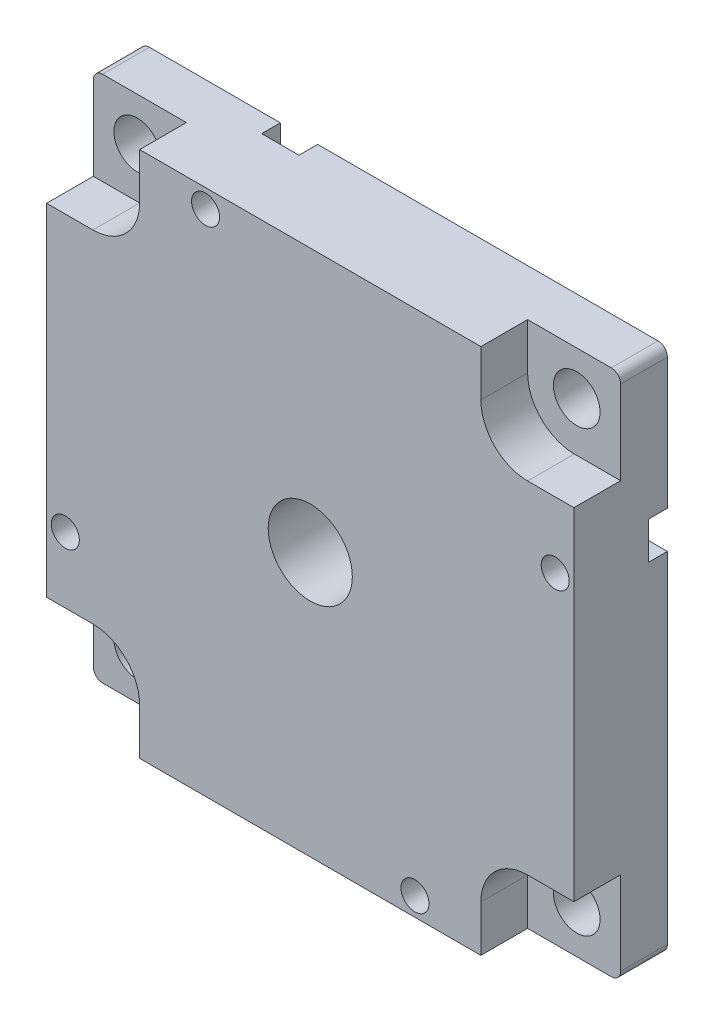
ISO-10303-21;
HEADER;
FILE_DESCRIPTION(('STEP AP214'),'2;1');
FILE_NAME('part.step','',(''),(''),'','','');
FILE_SCHEMA(('AUTOMOTIVE_DESIGN { 1 0 10303 214 1 1 1 1 }'));
ENDSEC;
DATA;
#1=APPLICATION_CONTEXT('core data for automotive mechanical design processes');
#2=APPLICATION_PROTOCOL_DEFINITION('international standard','automotive_design',2000,#1);
#3=PRODUCT_CONTEXT('',#1,'mechanical');
#4=PRODUCT('Part','Part','',(#3));
#5=PRODUCT_RELATED_PRODUCT_CATEGORY('part','',(#4));
#6=PRODUCT_DEFINITION_FORMATION('','',#4);
#7=PRODUCT_DEFINITION_CONTEXT('part definition',#1,'design');
#8=PRODUCT_DEFINITION('design','',#6,#7);
#9=PRODUCT_DEFINITION_SHAPE('','',#8);
#10=(LENGTH_UNIT() NAMED_UNIT(*) SI_UNIT(.MILLI.,.METRE.));
#11=(NAMED_UNIT(*) PLANE_ANGLE_UNIT() SI_UNIT($,.RADIAN.));
#12=(NAMED_UNIT(*) SI_UNIT($,.STERADIAN.) SOLID_ANGLE_UNIT());
#13=UNCERTAINTY_MEASURE_WITH_UNIT(LENGTH_MEASURE(1.E-05),#10,'distance_accuracy_value','');
#14=(GEOMETRIC_REPRESENTATION_CONTEXT(3) GLOBAL_UNCERTAINTY_ASSIGNED_CONTEXT((#13)) GLOBAL_UNIT_ASSIGNED_CONTEXT((#10,
#11,#12)) REPRESENTATION_CONTEXT('',''));
#15=CARTESIAN_POINT('',(0.,0.,0.));
#16=DIRECTION('',(0.,0.,1.));
#17=DIRECTION('',(1.,0.,0.));
#18=AXIS2_PLACEMENT_3D('',#15,#16,#17);
#19=CARTESIAN_POINT('',(0.,0.,5.));
#20=DIRECTION('',(0.,0.,1.));
#21=DIRECTION('',(1.,0.,0.));
#22=AXIS2_PLACEMENT_3D('',#19,#20,#21);
#23=PLANE('',#22);
#24=CARTESIAN_POINT('',(-23.4999999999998,23.5000000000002,5.));
#25=DIRECTION('',(0.,0.,1.));
#26=DIRECTION('',(1.,0.,0.));
#27=AXIS2_PLACEMENT_3D('',#24,#25,#26);
#28=CIRCLE('',#27,2.5);
#29=CARTESIAN_POINT('',(-20.9999999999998,23.5000000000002,5.));
#30=VERTEX_POINT('',#29);
#31=EDGE_CURVE('E413',#30,#30,#28,.T.);
#32=ORIENTED_EDGE('',*,*,#31,.F.);
#33=EDGE_LOOP('',(#32));
#34=FACE_BOUND('',#33,.T.);
#35=DIRECTION('',(-1.,0.,0.));
#36=VECTOR('',#35,1.);
#37=CARTESIAN_POINT('',(-18.25,18.25,5.));
#38=LINE('',#37,#36);
#39=CARTESIAN_POINT('',(-23.25,18.25,5.));
#40=VERTEX_POINT('',#39);
#41=CARTESIAN_POINT('',(-28.2,18.25,5.));
#42=VERTEX_POINT('',#41);
#43=EDGE_CURVE('E437',#40,#42,#38,.T.);
#44=ORIENTED_EDGE('',*,*,#43,.F.);
#45=CARTESIAN_POINT('',(-23.25,23.25,5.));
#46=DIRECTION('',(0.,0.,1.));
#47=DIRECTION('',(1.,0.,0.));
#48=AXIS2_PLACEMENT_3D('',#45,#46,#47);
#49=CIRCLE('',#48,5.);
#50=CARTESIAN_POINT('',(-18.25,23.25,5.));
#51=VERTEX_POINT('',#50);
#52=EDGE_CURVE('E481',#40,#51,#49,.T.);
#53=ORIENTED_EDGE('',*,*,#52,.T.);
#54=DIRECTION('',(0.,-1.,0.));
#55=VECTOR('',#54,1.);
#56=CARTESIAN_POINT('',(-18.25,18.25,5.));
#57=LINE('',#56,#55);
#58=CARTESIAN_POINT('',(-18.25,28.2,5.));
#59=VERTEX_POINT('',#58);
#60=EDGE_CURVE('E441',#59,#51,#57,.T.);
#61=ORIENTED_EDGE('',*,*,#60,.F.);
#62=DIRECTION('',(-1.,0.,0.));
#63=VECTOR('',#62,1.);
#64=CARTESIAN_POINT('',(28.2,28.2,5.));
#65=LINE('',#64,#63);
#66=CARTESIAN_POINT('',(-27.2,28.2,5.));
#67=VERTEX_POINT('',#66);
#68=EDGE_CURVE('E549',#59,#67,#65,.T.);
#69=ORIENTED_EDGE('',*,*,#68,.T.);
#70=CARTESIAN_POINT('',(-27.2,27.2,5.));
#71=DIRECTION('',(0.,0.,1.));
#72=DIRECTION('',(1.,0.,0.));
#73=AXIS2_PLACEMENT_3D('',#70,#71,#72);
#74=CIRCLE('',#73,1.);
#75=CARTESIAN_POINT('',(-28.2,27.2,5.));
#76=VERTEX_POINT('',#75);
#77=EDGE_CURVE('E604',#67,#76,#74,.T.);
#78=ORIENTED_EDGE('',*,*,#77,.T.);
#79=DIRECTION('',(0.,-1.,0.));
#80=VECTOR('',#79,1.);
#81=CARTESIAN_POINT('',(-28.2,-28.2,5.));
#82=LINE('',#81,#80);
#83=EDGE_CURVE('E545',#76,#42,#82,.T.);
#84=ORIENTED_EDGE('',*,*,#83,.T.);
#85=EDGE_LOOP('',(#44,#53,#61,#69,#78,#84));
#86=FACE_BOUND('',#85,.T.);
#87=ADVANCED_FACE('F35',(#34,#86),#23,.T.);
#88=CARTESIAN_POINT('',(23.5,23.5,5.));
#89=DIRECTION('',(0.,0.,1.));
#90=DIRECTION('',(1.,0.,0.));
#91=AXIS2_PLACEMENT_3D('',#88,#89,#90);
#92=CIRCLE('',#91,2.5);
#93=CARTESIAN_POINT('',(26.,23.5,5.));
#94=VERTEX_POINT('',#93);
#95=EDGE_CURVE('E431',#94,#94,#92,.T.);
#96=ORIENTED_EDGE('',*,*,#95,.F.);
#97=EDGE_LOOP('',(#96));
#98=FACE_BOUND('',#97,.T.);
#99=DIRECTION('',(0.,1.,0.));
#100=VECTOR('',#99,1.);
#101=CARTESIAN_POINT('',(18.25,18.25,5.));
#102=LINE('',#101,#100);
#103=CARTESIAN_POINT('',(18.25,23.25,5.));
#104=VERTEX_POINT('',#103);
#105=CARTESIAN_POINT('',(18.25,28.2,5.));
#106=VERTEX_POINT('',#105);
#107=EDGE_CURVE('E512',#104,#106,#102,.T.);
#108=ORIENTED_EDGE('',*,*,#107,.F.);
#109=CARTESIAN_POINT('',(23.25,23.25,5.));
#110=DIRECTION('',(0.,0.,1.));
#111=DIRECTION('',(1.,0.,0.));
#112=AXIS2_PLACEMENT_3D('',#109,#110,#111);
#113=CIRCLE('',#112,5.);
#114=CARTESIAN_POINT('',(23.25,18.25,5.));
#115=VERTEX_POINT('',#114);
#116=EDGE_CURVE('E506',#104,#115,#113,.T.);
#117=ORIENTED_EDGE('',*,*,#116,.T.);
#118=DIRECTION('',(-1.,0.,0.));
#119=VECTOR('',#118,1.);
#120=CARTESIAN_POINT('',(28.2,18.25,5.));
#121=LINE('',#120,#119);
#122=CARTESIAN_POINT('',(28.2,18.25,5.));
#123=VERTEX_POINT('',#122);
#124=EDGE_CURVE('E514',#123,#115,#121,.T.);
#125=ORIENTED_EDGE('',*,*,#124,.F.);
#126=DIRECTION('',(0.,1.,0.));
#127=VECTOR('',#126,1.);
#128=CARTESIAN_POINT('',(28.2,-28.2,5.));
#129=LINE('',#128,#127);
#130=CARTESIAN_POINT('',(28.2,27.2,5.));
#131=VERTEX_POINT('',#130);
#132=EDGE_CURVE('E671',#123,#131,#129,.T.);
#133=ORIENTED_EDGE('',*,*,#132,.T.);
#134=CARTESIAN_POINT('',(27.2,27.2,5.));
#135=DIRECTION('',(0.,0.,1.));
#136=DIRECTION('',(1.,0.,0.));
#137=AXIS2_PLACEMENT_3D('',#134,#135,#136);
#138=CIRCLE('',#137,1.);
#139=CARTESIAN_POINT('',(27.2,28.2,5.));
#140=VERTEX_POINT('',#139);
#141=EDGE_CURVE('E598',#131,#140,#138,.T.);
#142=ORIENTED_EDGE('',*,*,#141,.T.);
#143=EDGE_CURVE('E552',#140,#106,#65,.T.);
#144=ORIENTED_EDGE('',*,*,#143,.T.);
#145=EDGE_LOOP('',(#108,#117,#125,#133,#142,#144));
#146=FACE_BOUND('',#145,.T.);
#147=ADVANCED_FACE('F801',(#98,#146),#23,.T.);
#148=CARTESIAN_POINT('',(23.4999999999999,-23.5000000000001,5.));
#149=DIRECTION('',(0.,0.,1.));
#150=DIRECTION('',(1.,0.,0.));
#151=AXIS2_PLACEMENT_3D('',#148,#149,#150);
#152=CIRCLE('',#151,2.5);
#153=CARTESIAN_POINT('',(25.9999999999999,-23.5000000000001,5.));
#154=VERTEX_POINT('',#153);
#155=EDGE_CURVE('E425',#154,#154,#152,.T.);
#156=ORIENTED_EDGE('',*,*,#155,.F.);
#157=EDGE_LOOP('',(#156));
#158=FACE_BOUND('',#157,.T.);
#159=DIRECTION('',(1.,0.,0.));
#160=VECTOR('',#159,1.);
#161=CARTESIAN_POINT('',(28.2,-18.25,5.));
#162=LINE('',#161,#160);
#163=CARTESIAN_POINT('',(23.25,-18.25,5.));
#164=VERTEX_POINT('',#163);
#165=CARTESIAN_POINT('',(28.2,-18.25,5.));
#166=VERTEX_POINT('',#165);
#167=EDGE_CURVE('E636',#164,#166,#162,.T.);
#168=ORIENTED_EDGE('',*,*,#167,.F.);
#169=CARTESIAN_POINT('',(23.25,-23.25,5.));
#170=DIRECTION('',(0.,0.,1.));
#171=DIRECTION('',(1.,0.,0.));
#172=AXIS2_PLACEMENT_3D('',#169,#170,#171);
#173=CIRCLE('',#172,5.);
#174=CARTESIAN_POINT('',(18.25,-23.25,5.));
#175=VERTEX_POINT('',#174);
#176=EDGE_CURVE('E509',#164,#175,#173,.T.);
#177=ORIENTED_EDGE('',*,*,#176,.T.);
#178=DIRECTION('',(0.,1.,0.));
#179=VECTOR('',#178,1.);
#180=CARTESIAN_POINT('',(18.25,-28.2,5.));
#181=LINE('',#180,#179);
#182=CARTESIAN_POINT('',(18.25,-28.2,5.));
#183=VERTEX_POINT('',#182);
#184=EDGE_CURVE('E638',#183,#175,#181,.T.);
#185=ORIENTED_EDGE('',*,*,#184,.F.);
#186=DIRECTION('',(1.,0.,0.));
#187=VECTOR('',#186,1.);
#188=CARTESIAN_POINT('',(28.2,-28.2,5.));
#189=LINE('',#188,#187);
#190=CARTESIAN_POINT('',(27.2,-28.2,5.));
#191=VERTEX_POINT('',#190);
#192=EDGE_CURVE('E548',#183,#191,#189,.T.);
#193=ORIENTED_EDGE('',*,*,#192,.T.);
#194=CARTESIAN_POINT('',(27.2,-27.2,5.));
#195=DIRECTION('',(0.,0.,1.));
#196=DIRECTION('',(1.,0.,0.));
#197=AXIS2_PLACEMENT_3D('',#194,#195,#196);
#198=CIRCLE('',#197,1.);
#199=CARTESIAN_POINT('',(28.2,-27.2,5.));
#200=VERTEX_POINT('',#199);
#201=EDGE_CURVE('E600',#191,#200,#198,.T.);
#202=ORIENTED_EDGE('',*,*,#201,.T.);
#203=EDGE_CURVE('E553',#200,#166,#129,.T.);
#204=ORIENTED_EDGE('',*,*,#203,.T.);
#205=EDGE_LOOP('',(#168,#177,#185,#193,#202,#204));
#206=FACE_BOUND('',#205,.T.);
#207=ADVANCED_FACE('F643',(#158,#206),#23,.T.);
#208=CARTESIAN_POINT('',(-28.2,-28.2,5.));
#209=DIRECTION('',(1.,0.,0.));
#210=DIRECTION('',(0.,0.,-1.));
#211=AXIS2_PLACEMENT_3D('',#208,#209,#210);
#212=PLANE('',#211);
#213=DIRECTION('',(0.,-1.,0.));
#214=VECTOR('',#213,1.);
#215=CARTESIAN_POINT('',(-28.2,-28.2,0.));
#216=LINE('',#215,#214);
#217=CARTESIAN_POINT('',(-28.2,27.2,0.));
#218=VERTEX_POINT('',#217);
#219=CARTESIAN_POINT('',(-28.2000000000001,-9.1999999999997,0.));
#220=VERTEX_POINT('',#219);
#221=EDGE_CURVE('E558',#218,#220,#216,.T.);
#222=ORIENTED_EDGE('',*,*,#221,.T.);
#223=DIRECTION('',(0.,0.,-1.));
#224=VECTOR('',#223,1.);
#225=CARTESIAN_POINT('',(-28.2000000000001,-9.1999999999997,2.));
#226=LINE('',#225,#224);
#227=CARTESIAN_POINT('',(-28.2000000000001,-9.1999999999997,2.));
#228=VERTEX_POINT('',#227);
#229=EDGE_CURVE('E325',#228,#220,#226,.T.);
#230=ORIENTED_EDGE('',*,*,#229,.F.);
#231=DIRECTION('',(0.,1.,0.));
#232=VECTOR('',#231,1.);
#233=CARTESIAN_POINT('',(-28.2000000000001,-9.1999999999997,2.));
#234=LINE('',#233,#232);
#235=CARTESIAN_POINT('',(-28.2000000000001,-13.1999999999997,2.));
#236=VERTEX_POINT('',#235);
#237=EDGE_CURVE('E306',#236,#228,#234,.T.);
#238=ORIENTED_EDGE('',*,*,#237,.F.);
#239=DIRECTION('',(0.,0.,-1.));
#240=VECTOR('',#239,1.);
#241=CARTESIAN_POINT('',(-28.2000000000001,-13.1999999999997,2.));
#242=LINE('',#241,#240);
#243=CARTESIAN_POINT('',(-28.2000000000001,-13.1999999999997,0.));
#244=VERTEX_POINT('',#243);
#245=EDGE_CURVE('E297',#236,#244,#242,.T.);
#246=ORIENTED_EDGE('',*,*,#245,.T.);
#247=CARTESIAN_POINT('',(-28.2,-27.2,0.));
#248=VERTEX_POINT('',#247);
#249=EDGE_CURVE('E533',#244,#248,#216,.T.);
#250=ORIENTED_EDGE('',*,*,#249,.T.);
#251=DIRECTION('',(0.,0.,-1.));
#252=VECTOR('',#251,1.);
#253=CARTESIAN_POINT('',(-28.2,-27.2,5.));
#254=LINE('',#253,#252);
#255=CARTESIAN_POINT('',(-28.2,-27.2,5.));
#256=VERTEX_POINT('',#255);
#257=EDGE_CURVE('E574',#248,#256,#254,.F.);
#258=ORIENTED_EDGE('',*,*,#257,.T.);
#259=CARTESIAN_POINT('',(-28.2,-18.25,5.));
#260=VERTEX_POINT('',#259);
#261=EDGE_CURVE('E542',#260,#256,#82,.T.);
#262=ORIENTED_EDGE('',*,*,#261,.F.);
#263=DIRECTION('',(0.,0.,-1.));
#264=VECTOR('',#263,1.);
#265=CARTESIAN_POINT('',(-28.2,-18.25,10.));
#266=LINE('',#265,#264);
#267=CARTESIAN_POINT('',(-28.2,-18.25,10.));
#268=VERTEX_POINT('',#267);
#269=EDGE_CURVE('E695',#268,#260,#266,.T.);
#270=ORIENTED_EDGE('',*,*,#269,.F.);
#271=DIRECTION('',(0.,-1.,0.));
#272=VECTOR('',#271,1.);
#273=CARTESIAN_POINT('',(-28.2,-18.25,10.));
#274=LINE('',#273,#272);
#275=CARTESIAN_POINT('',(-28.2,18.25,10.));
#276=VERTEX_POINT('',#275);
#277=EDGE_CURVE('E440',#276,#268,#274,.T.);
#278=ORIENTED_EDGE('',*,*,#277,.F.);
#279=DIRECTION('',(0.,0.,-1.));
#280=VECTOR('',#279,1.);
#281=CARTESIAN_POINT('',(-28.2,18.25,10.));
#282=LINE('',#281,#280);
#283=EDGE_CURVE('E523',#276,#42,#282,.T.);
#284=ORIENTED_EDGE('',*,*,#283,.T.);
#285=ORIENTED_EDGE('',*,*,#83,.F.);
#286=DIRECTION('',(0.,0.,-1.));
#287=VECTOR('',#286,1.);
#288=CARTESIAN_POINT('',(-28.2,27.2,5.));
#289=LINE('',#288,#287);
#290=EDGE_CURVE('E577',#76,#218,#289,.T.);
#291=ORIENTED_EDGE('',*,*,#290,.T.);
#292=EDGE_LOOP('',(#222,#230,#238,#246,#250,#258,#262,#270,#278,#284,#285,#291));
#293=FACE_BOUND('',#292,.T.);
#294=ADVANCED_FACE('F748',(#293),#212,.F.);
#295=CARTESIAN_POINT('',(28.2,-28.2,5.));
#296=DIRECTION('',(0.,1.,0.));
#297=DIRECTION('',(-1.,0.,0.));
#298=AXIS2_PLACEMENT_3D('',#295,#296,#297);
#299=PLANE('',#298);
#300=DIRECTION('',(1.,0.,0.));
#301=VECTOR('',#300,1.);
#302=CARTESIAN_POINT('',(28.2,-28.2,0.));
#303=LINE('',#302,#301);
#304=CARTESIAN_POINT('',(-27.2,-28.2,0.));
#305=VERTEX_POINT('',#304);
#306=CARTESIAN_POINT('',(9.19999999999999,-28.2,0.));
#307=VERTEX_POINT('',#306);
#308=EDGE_CURVE('E563',#305,#307,#303,.T.);
#309=ORIENTED_EDGE('',*,*,#308,.T.);
#310=DIRECTION('',(0.,0.,-1.));
#311=VECTOR('',#310,1.);
#312=CARTESIAN_POINT('',(9.19999999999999,-28.2,2.));
#313=LINE('',#312,#311);
#314=CARTESIAN_POINT('',(9.19999999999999,-28.2,2.));
#315=VERTEX_POINT('',#314);
#316=EDGE_CURVE('E349',#315,#307,#313,.T.);
#317=ORIENTED_EDGE('',*,*,#316,.F.);
#318=DIRECTION('',(-1.,0.,0.));
#319=VECTOR('',#318,1.);
#320=CARTESIAN_POINT('',(9.19999999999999,-28.2,2.));
#321=LINE('',#320,#319);
#322=CARTESIAN_POINT('',(13.2,-28.2,2.));
#323=VERTEX_POINT('',#322);
#324=EDGE_CURVE('E335',#323,#315,#321,.T.);
#325=ORIENTED_EDGE('',*,*,#324,.F.);
#326=DIRECTION('',(0.,0.,-1.));
#327=VECTOR('',#326,1.);
#328=CARTESIAN_POINT('',(13.2,-28.2,2.));
#329=LINE('',#328,#327);
#330=CARTESIAN_POINT('',(13.2,-28.2,0.));
#331=VERTEX_POINT('',#330);
#332=EDGE_CURVE('E351',#323,#331,#329,.T.);
#333=ORIENTED_EDGE('',*,*,#332,.T.);
#334=CARTESIAN_POINT('',(27.2,-28.2,0.));
#335=VERTEX_POINT('',#334);
#336=EDGE_CURVE('E562',#331,#335,#303,.T.);
#337=ORIENTED_EDGE('',*,*,#336,.T.);
#338=DIRECTION('',(0.,0.,-1.));
#339=VECTOR('',#338,1.);
#340=CARTESIAN_POINT('',(27.2,-28.2,5.));
#341=LINE('',#340,#339);
#342=EDGE_CURVE('E606',#335,#191,#341,.F.);
#343=ORIENTED_EDGE('',*,*,#342,.T.);
#344=ORIENTED_EDGE('',*,*,#192,.F.);
#345=DIRECTION('',(0.,0.,-1.));
#346=VECTOR('',#345,1.);
#347=CARTESIAN_POINT('',(18.25,-28.2,10.));
#348=LINE('',#347,#346);
#349=CARTESIAN_POINT('',(18.25,-28.2,10.));
#350=VERTEX_POINT('',#349);
#351=EDGE_CURVE('E654',#350,#183,#348,.T.);
#352=ORIENTED_EDGE('',*,*,#351,.F.);
#353=DIRECTION('',(1.,0.,0.));
#354=VECTOR('',#353,1.);
#355=CARTESIAN_POINT('',(18.25,-28.2,10.));
#356=LINE('',#355,#354);
#357=CARTESIAN_POINT('',(-18.25,-28.2,10.));
#358=VERTEX_POINT('',#357);
#359=EDGE_CURVE('E448',#358,#350,#356,.T.);
#360=ORIENTED_EDGE('',*,*,#359,.F.);
#361=DIRECTION('',(0.,0.,-1.));
#362=VECTOR('',#361,1.);
#363=CARTESIAN_POINT('',(-18.25,-28.2,10.));
#364=LINE('',#363,#362);
#365=CARTESIAN_POINT('',(-18.25,-28.2,5.));
#366=VERTEX_POINT('',#365);
#367=EDGE_CURVE('E691',#358,#366,#364,.T.);
#368=ORIENTED_EDGE('',*,*,#367,.T.);
#369=CARTESIAN_POINT('',(-27.2,-28.2,5.));
#370=VERTEX_POINT('',#369);
#371=EDGE_CURVE('E760',#370,#366,#189,.T.);
#372=ORIENTED_EDGE('',*,*,#371,.F.);
#373=DIRECTION('',(0.,0.,-1.));
#374=VECTOR('',#373,1.);
#375=CARTESIAN_POINT('',(-27.2,-28.2,5.));
#376=LINE('',#375,#374);
#377=EDGE_CURVE('E609',#370,#305,#376,.T.);
#378=ORIENTED_EDGE('',*,*,#377,.T.);
#379=EDGE_LOOP('',(#309,#317,#325,#333,#337,#343,#344,#352,#360,#368,#372,#378));
#380=FACE_BOUND('',#379,.T.);
#381=ADVANCED_FACE('F764',(#380),#299,.F.);
#382=CARTESIAN_POINT('',(28.2,-28.2,5.));
#383=DIRECTION('',(-1.,0.,0.));
#384=DIRECTION('',(0.,0.,1.));
#385=AXIS2_PLACEMENT_3D('',#382,#383,#384);
#386=PLANE('',#385);
#387=DIRECTION('',(0.,1.,0.));
#388=VECTOR('',#387,1.);
#389=CARTESIAN_POINT('',(28.2,-28.2,0.));
#390=LINE('',#389,#388);
#391=CARTESIAN_POINT('',(28.2,-27.2,0.));
#392=VERTEX_POINT('',#391);
#393=CARTESIAN_POINT('',(28.2,9.19999999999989,0.));
#394=VERTEX_POINT('',#393);
#395=EDGE_CURVE('E567',#392,#394,#390,.T.);
#396=ORIENTED_EDGE('',*,*,#395,.T.);
#397=DIRECTION('',(0.,0.,-1.));
#398=VECTOR('',#397,1.);
#399=CARTESIAN_POINT('',(28.2,9.19999999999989,2.));
#400=LINE('',#399,#398);
#401=CARTESIAN_POINT('',(28.2,9.19999999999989,2.));
#402=VERTEX_POINT('',#401);
#403=EDGE_CURVE('E376',#402,#394,#400,.T.);
#404=ORIENTED_EDGE('',*,*,#403,.F.);
#405=DIRECTION('',(0.,-1.,0.));
#406=VECTOR('',#405,1.);
#407=CARTESIAN_POINT('',(28.2,9.19999999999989,2.));
#408=LINE('',#407,#406);
#409=CARTESIAN_POINT('',(28.2,13.1999999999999,2.));
#410=VERTEX_POINT('',#409);
#411=EDGE_CURVE('E362',#410,#402,#408,.T.);
#412=ORIENTED_EDGE('',*,*,#411,.F.);
#413=DIRECTION('',(0.,0.,-1.));
#414=VECTOR('',#413,1.);
#415=CARTESIAN_POINT('',(28.2,13.1999999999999,2.));
#416=LINE('',#415,#414);
#417=CARTESIAN_POINT('',(28.2,13.1999999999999,0.));
#418=VERTEX_POINT('',#417);
#419=EDGE_CURVE('E378',#410,#418,#416,.T.);
#420=ORIENTED_EDGE('',*,*,#419,.T.);
#421=CARTESIAN_POINT('',(28.2,27.2,0.));
#422=VERTEX_POINT('',#421);
#423=EDGE_CURVE('E566',#418,#422,#390,.T.);
#424=ORIENTED_EDGE('',*,*,#423,.T.);
#425=DIRECTION('',(0.,0.,-1.));
#426=VECTOR('',#425,1.);
#427=CARTESIAN_POINT('',(28.2,27.2,5.));
#428=LINE('',#427,#426);
#429=EDGE_CURVE('E612',#422,#131,#428,.F.);
#430=ORIENTED_EDGE('',*,*,#429,.T.);
#431=ORIENTED_EDGE('',*,*,#132,.F.);
#432=DIRECTION('',(0.,0.,-1.));
#433=VECTOR('',#432,1.);
#434=CARTESIAN_POINT('',(28.2,18.25,10.));
#435=LINE('',#434,#433);
#436=CARTESIAN_POINT('',(28.2,18.25,10.));
#437=VERTEX_POINT('',#436);
#438=EDGE_CURVE('E665',#437,#123,#435,.T.);
#439=ORIENTED_EDGE('',*,*,#438,.F.);
#440=DIRECTION('',(0.,1.,0.));
#441=VECTOR('',#440,1.);
#442=CARTESIAN_POINT('',(28.2,-18.25,10.));
#443=LINE('',#442,#441);
#444=CARTESIAN_POINT('',(28.2,-18.25,10.));
#445=VERTEX_POINT('',#444);
#446=EDGE_CURVE('E455',#445,#437,#443,.T.);
#447=ORIENTED_EDGE('',*,*,#446,.F.);
#448=DIRECTION('',(0.,0.,-1.));
#449=VECTOR('',#448,1.);
#450=CARTESIAN_POINT('',(28.2,-18.25,10.));
#451=LINE('',#450,#449);
#452=EDGE_CURVE('E663',#445,#166,#451,.T.);
#453=ORIENTED_EDGE('',*,*,#452,.T.);
#454=ORIENTED_EDGE('',*,*,#203,.F.);
#455=DIRECTION('',(0.,0.,-1.));
#456=VECTOR('',#455,1.);
#457=CARTESIAN_POINT('',(28.2,-27.2,5.));
#458=LINE('',#457,#456);
#459=EDGE_CURVE('E614',#200,#392,#458,.T.);
#460=ORIENTED_EDGE('',*,*,#459,.T.);
#461=EDGE_LOOP('',(#396,#404,#412,#420,#424,#430,#431,#439,#447,#453,#454,#460));
#462=FACE_BOUND('',#461,.T.);
#463=ADVANCED_FACE('F668',(#462),#386,.F.);
#464=CARTESIAN_POINT('',(28.2,28.2,5.));
#465=DIRECTION('',(0.,-1.,0.));
#466=DIRECTION('',(1.,0.,0.));
#467=AXIS2_PLACEMENT_3D('',#464,#465,#466);
#468=PLANE('',#467);
#469=DIRECTION('',(-1.,0.,0.));
#470=VECTOR('',#469,1.);
#471=CARTESIAN_POINT('',(28.2,28.2,0.));
#472=LINE('',#471,#470);
#473=CARTESIAN_POINT('',(27.2,28.2,0.));
#474=VERTEX_POINT('',#473);
#475=CARTESIAN_POINT('',(-9.19999999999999,28.2,0.));
#476=VERTEX_POINT('',#475);
#477=EDGE_CURVE('E571',#474,#476,#472,.T.);
#478=ORIENTED_EDGE('',*,*,#477,.T.);
#479=DIRECTION('',(0.,0.,-1.));
#480=VECTOR('',#479,1.);
#481=CARTESIAN_POINT('',(-9.19999999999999,28.2,2.));
#482=LINE('',#481,#480);
#483=CARTESIAN_POINT('',(-9.19999999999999,28.2,2.));
#484=VERTEX_POINT('',#483);
#485=EDGE_CURVE('E404',#484,#476,#482,.T.);
#486=ORIENTED_EDGE('',*,*,#485,.F.);
#487=DIRECTION('',(1.,0.,0.));
#488=VECTOR('',#487,1.);
#489=CARTESIAN_POINT('',(-9.19999999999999,28.2,2.));
#490=LINE('',#489,#488);
#491=CARTESIAN_POINT('',(-13.2,28.2,2.));
#492=VERTEX_POINT('',#491);
#493=EDGE_CURVE('E390',#492,#484,#490,.T.);
#494=ORIENTED_EDGE('',*,*,#493,.F.);
#495=DIRECTION('',(0.,0.,-1.));
#496=VECTOR('',#495,1.);
#497=CARTESIAN_POINT('',(-13.2,28.2,2.));
#498=LINE('',#497,#496);
#499=CARTESIAN_POINT('',(-13.2,28.2,0.));
#500=VERTEX_POINT('',#499);
#501=EDGE_CURVE('E406',#492,#500,#498,.T.);
#502=ORIENTED_EDGE('',*,*,#501,.T.);
#503=CARTESIAN_POINT('',(-27.2,28.2,0.));
#504=VERTEX_POINT('',#503);
#505=EDGE_CURVE('E570',#500,#504,#472,.T.);
#506=ORIENTED_EDGE('',*,*,#505,.T.);
#507=DIRECTION('',(0.,0.,-1.));
#508=VECTOR('',#507,1.);
#509=CARTESIAN_POINT('',(-27.2,28.2,5.));
#510=LINE('',#509,#508);
#511=EDGE_CURVE('E595',#504,#67,#510,.F.);
#512=ORIENTED_EDGE('',*,*,#511,.T.);
#513=ORIENTED_EDGE('',*,*,#68,.F.);
#514=DIRECTION('',(0.,0.,-1.));
#515=VECTOR('',#514,1.);
#516=CARTESIAN_POINT('',(-18.25,28.2,10.));
#517=LINE('',#516,#515);
#518=CARTESIAN_POINT('',(-18.25,28.2,10.));
#519=VERTEX_POINT('',#518);
#520=EDGE_CURVE('E467',#519,#59,#517,.T.);
#521=ORIENTED_EDGE('',*,*,#520,.F.);
#522=DIRECTION('',(-1.,0.,0.));
#523=VECTOR('',#522,1.);
#524=CARTESIAN_POINT('',(18.25,28.2,10.));
#525=LINE('',#524,#523);
#526=CARTESIAN_POINT('',(18.25,28.2,10.));
#527=VERTEX_POINT('',#526);
#528=EDGE_CURVE('E462',#527,#519,#525,.T.);
#529=ORIENTED_EDGE('',*,*,#528,.F.);
#530=DIRECTION('',(0.,0.,-1.));
#531=VECTOR('',#530,1.);
#532=CARTESIAN_POINT('',(18.25,28.2,10.));
#533=LINE('',#532,#531);
#534=EDGE_CURVE('E503',#527,#106,#533,.T.);
#535=ORIENTED_EDGE('',*,*,#534,.T.);
#536=ORIENTED_EDGE('',*,*,#143,.F.);
#537=DIRECTION('',(0.,0.,-1.));
#538=VECTOR('',#537,1.);
#539=CARTESIAN_POINT('',(27.2,28.2,5.));
#540=LINE('',#539,#538);
#541=EDGE_CURVE('E592',#140,#474,#540,.T.);
#542=ORIENTED_EDGE('',*,*,#541,.T.);
#543=EDGE_LOOP('',(#478,#486,#494,#502,#506,#512,#513,#521,#529,#535,#536,#542));
#544=FACE_BOUND('',#543,.T.);
#545=ADVANCED_FACE('F726',(#544),#468,.F.);
#546=CARTESIAN_POINT('',(-23.5,-23.5,5.));
#547=DIRECTION('',(0.,0.,1.));
#548=DIRECTION('',(1.,0.,0.));
#549=AXIS2_PLACEMENT_3D('',#546,#547,#548);
#550=CIRCLE('',#549,2.5);
#551=CARTESIAN_POINT('',(-21.,-23.5,5.));
#552=VERTEX_POINT('',#551);
#553=EDGE_CURVE('E419',#552,#552,#550,.T.);
#554=ORIENTED_EDGE('',*,*,#553,.F.);
#555=EDGE_LOOP('',(#554));
#556=FACE_BOUND('',#555,.T.);
#557=DIRECTION('',(0.,-1.,0.));
#558=VECTOR('',#557,1.);
#559=CARTESIAN_POINT('',(-18.25,-28.2,5.));
#560=LINE('',#559,#558);
#561=CARTESIAN_POINT('',(-18.25,-23.25,5.));
#562=VERTEX_POINT('',#561);
#563=EDGE_CURVE('E631',#562,#366,#560,.T.);
#564=ORIENTED_EDGE('',*,*,#563,.F.);
#565=CARTESIAN_POINT('',(-23.25,-23.25,5.));
#566=DIRECTION('',(0.,0.,1.));
#567=DIRECTION('',(1.,0.,0.));
#568=AXIS2_PLACEMENT_3D('',#565,#566,#567);
#569=CIRCLE('',#568,5.);
#570=CARTESIAN_POINT('',(-23.25,-18.25,5.));
#571=VERTEX_POINT('',#570);
#572=EDGE_CURVE('E622',#562,#571,#569,.T.);
#573=ORIENTED_EDGE('',*,*,#572,.T.);
#574=DIRECTION('',(1.,0.,0.));
#575=VECTOR('',#574,1.);
#576=CARTESIAN_POINT('',(-18.25,-18.25,5.));
#577=LINE('',#576,#575);
#578=EDGE_CURVE('E475',#260,#571,#577,.T.);
#579=ORIENTED_EDGE('',*,*,#578,.F.);
#580=ORIENTED_EDGE('',*,*,#261,.T.);
#581=CARTESIAN_POINT('',(-27.2,-27.2,5.));
#582=DIRECTION('',(0.,0.,1.));
#583=DIRECTION('',(1.,0.,0.));
#584=AXIS2_PLACEMENT_3D('',#581,#582,#583);
#585=CIRCLE('',#584,1.);
#586=EDGE_CURVE('E602',#256,#370,#585,.T.);
#587=ORIENTED_EDGE('',*,*,#586,.T.);
#588=ORIENTED_EDGE('',*,*,#371,.T.);
#589=EDGE_LOOP('',(#564,#573,#579,#580,#587,#588));
#590=FACE_BOUND('',#589,.T.);
#591=ADVANCED_FACE('F755',(#556,#590),#23,.T.);
#592=CARTESIAN_POINT('',(0.,0.,0.));
#593=DIRECTION('',(0.,0.,1.));
#594=DIRECTION('',(1.,0.,0.));
#595=AXIS2_PLACEMENT_3D('',#592,#593,#594);
#596=PLANE('',#595);
#597=CARTESIAN_POINT('',(-23.4999999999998,23.5000000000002,0.));
#598=DIRECTION('',(0.,0.,-1.));
#599=DIRECTION('',(0.,-1.,0.));
#600=AXIS2_PLACEMENT_3D('',#597,#598,#599);
#601=CIRCLE('',#600,2.5);
#602=CARTESIAN_POINT('',(-23.4999999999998,21.0000000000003,0.));
#603=VERTEX_POINT('',#602);
#604=EDGE_CURVE('E403',#603,#603,#601,.T.);
#605=ORIENTED_EDGE('',*,*,#604,.F.);
#606=EDGE_LOOP('',(#605));
#607=FACE_BOUND('',#606,.T.);
#608=CARTESIAN_POINT('',(-23.5,-23.5,0.));
#609=DIRECTION('',(0.,0.,-1.));
#610=DIRECTION('',(1.,0.,0.));
#611=AXIS2_PLACEMENT_3D('',#608,#609,#610);
#612=CIRCLE('',#611,2.5);
#613=CARTESIAN_POINT('',(-21.,-23.5,0.));
#614=VERTEX_POINT('',#613);
#615=EDGE_CURVE('E416',#614,#614,#612,.T.);
#616=ORIENTED_EDGE('',*,*,#615,.F.);
#617=EDGE_LOOP('',(#616));
#618=FACE_BOUND('',#617,.T.);
#619=CARTESIAN_POINT('',(23.4999999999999,-23.5000000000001,0.));
#620=DIRECTION('',(0.,0.,-1.));
#621=DIRECTION('',(0.,1.,0.));
#622=AXIS2_PLACEMENT_3D('',#619,#620,#621);
#623=CIRCLE('',#622,2.5);
#624=CARTESIAN_POINT('',(23.4999999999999,-21.0000000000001,0.));
#625=VERTEX_POINT('',#624);
#626=EDGE_CURVE('E422',#625,#625,#623,.T.);
#627=ORIENTED_EDGE('',*,*,#626,.F.);
#628=EDGE_LOOP('',(#627));
#629=FACE_BOUND('',#628,.T.);
#630=CARTESIAN_POINT('',(23.5,23.5,0.));
#631=DIRECTION('',(0.,0.,-1.));
#632=DIRECTION('',(-1.,0.,0.));
#633=AXIS2_PLACEMENT_3D('',#630,#631,#632);
#634=CIRCLE('',#633,2.5);
#635=CARTESIAN_POINT('',(21.,23.5,0.));
#636=VERTEX_POINT('',#635);
#637=EDGE_CURVE('E428',#636,#636,#634,.T.);
#638=ORIENTED_EDGE('',*,*,#637,.F.);
#639=EDGE_LOOP('',(#638));
#640=FACE_BOUND('',#639,.T.);
#641=CARTESIAN_POINT('',(0.,0.,0.));
#642=DIRECTION('',(0.,0.,-1.));
#643=DIRECTION('',(-1.,0.,0.));
#644=AXIS2_PLACEMENT_3D('',#641,#642,#643);
#645=CIRCLE('',#644,20.);
#646=CARTESIAN_POINT('',(-20.,0.,0.));
#647=VERTEX_POINT('',#646);
#648=EDGE_CURVE('E529',#647,#647,#645,.T.);
#649=ORIENTED_EDGE('',*,*,#648,.F.);
#650=EDGE_LOOP('',(#649));
#651=FACE_BOUND('',#650,.T.);
#652=CARTESIAN_POINT('',(-26.2000000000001,-11.1999999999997,0.));
#653=DIRECTION('',(0.,0.,-1.));
#654=DIRECTION('',(0.,-1.,0.));
#655=AXIS2_PLACEMENT_3D('',#652,#653,#654);
#656=CIRCLE('',#655,2.);
#657=CARTESIAN_POINT('',(-26.2000000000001,-9.19999999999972,0.));
#658=VERTEX_POINT('',#657);
#659=CARTESIAN_POINT('',(-26.2000000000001,-13.1999999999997,0.));
#660=VERTEX_POINT('',#659);
#661=EDGE_CURVE('E50',#658,#660,#656,.T.);
#662=ORIENTED_EDGE('',*,*,#661,.F.);
#663=DIRECTION('',(1.,0.,0.));
#664=VECTOR('',#663,1.);
#665=CARTESIAN_POINT('',(-26.2000000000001,-9.19999999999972,0.));
#666=LINE('',#665,#664);
#667=EDGE_CURVE('E310',#220,#658,#666,.T.);
#668=ORIENTED_EDGE('',*,*,#667,.F.);
#669=ORIENTED_EDGE('',*,*,#221,.F.);
#670=CARTESIAN_POINT('',(-27.2,27.2,0.));
#671=DIRECTION('',(0.,0.,1.));
#672=DIRECTION('',(1.,0.,0.));
#673=AXIS2_PLACEMENT_3D('',#670,#671,#672);
#674=CIRCLE('',#673,1.);
#675=EDGE_CURVE('E589',#218,#504,#674,.F.);
#676=ORIENTED_EDGE('',*,*,#675,.T.);
#677=ORIENTED_EDGE('',*,*,#505,.F.);
#678=DIRECTION('',(0.,1.,0.));
#679=VECTOR('',#678,1.);
#680=CARTESIAN_POINT('',(-13.2,26.2,0.));
#681=LINE('',#680,#679);
#682=CARTESIAN_POINT('',(-13.2,26.2,0.));
#683=VERTEX_POINT('',#682);
#684=EDGE_CURVE('E397',#683,#500,#681,.T.);
#685=ORIENTED_EDGE('',*,*,#684,.F.);
#686=CARTESIAN_POINT('',(-11.2,26.2,0.));
#687=DIRECTION('',(0.,0.,-1.));
#688=DIRECTION('',(-1.,0.,0.));
#689=AXIS2_PLACEMENT_3D('',#686,#687,#688);
#690=CIRCLE('',#689,2.);
#691=CARTESIAN_POINT('',(-9.19999999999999,26.2,0.));
#692=VERTEX_POINT('',#691);
#693=EDGE_CURVE('E375',#692,#683,#690,.T.);
#694=ORIENTED_EDGE('',*,*,#693,.F.);
#695=DIRECTION('',(0.,-1.,0.));
#696=VECTOR('',#695,1.);
#697=CARTESIAN_POINT('',(-9.19999999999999,26.2,0.));
#698=LINE('',#697,#696);
#699=EDGE_CURVE('E387',#476,#692,#698,.T.);
#700=ORIENTED_EDGE('',*,*,#699,.F.);
#701=ORIENTED_EDGE('',*,*,#477,.F.);
#702=CARTESIAN_POINT('',(27.2,27.2,0.));
#703=DIRECTION('',(0.,0.,1.));
#704=DIRECTION('',(1.,0.,0.));
#705=AXIS2_PLACEMENT_3D('',#702,#703,#704);
#706=CIRCLE('',#705,1.);
#707=EDGE_CURVE('E580',#474,#422,#706,.F.);
#708=ORIENTED_EDGE('',*,*,#707,.T.);
#709=ORIENTED_EDGE('',*,*,#423,.F.);
#710=DIRECTION('',(1.,0.,0.));
#711=VECTOR('',#710,1.);
#712=CARTESIAN_POINT('',(26.2,13.1999999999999,0.));
#713=LINE('',#712,#711);
#714=CARTESIAN_POINT('',(26.2,13.1999999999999,0.));
#715=VERTEX_POINT('',#714);
#716=EDGE_CURVE('E369',#715,#418,#713,.T.);
#717=ORIENTED_EDGE('',*,*,#716,.F.);
#718=CARTESIAN_POINT('',(26.2,11.1999999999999,0.));
#719=DIRECTION('',(0.,0.,-1.));
#720=DIRECTION('',(0.,1.,0.));
#721=AXIS2_PLACEMENT_3D('',#718,#719,#720);
#722=CIRCLE('',#721,2.);
#723=CARTESIAN_POINT('',(26.2,9.1999999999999,0.));
#724=VERTEX_POINT('',#723);
#725=EDGE_CURVE('E348',#724,#715,#722,.T.);
#726=ORIENTED_EDGE('',*,*,#725,.F.);
#727=DIRECTION('',(-1.,0.,0.));
#728=VECTOR('',#727,1.);
#729=CARTESIAN_POINT('',(26.2,9.1999999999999,0.));
#730=LINE('',#729,#728);
#731=EDGE_CURVE('E359',#394,#724,#730,.T.);
#732=ORIENTED_EDGE('',*,*,#731,.F.);
#733=ORIENTED_EDGE('',*,*,#395,.F.);
#734=CARTESIAN_POINT('',(27.2,-27.2,0.));
#735=DIRECTION('',(0.,0.,1.));
#736=DIRECTION('',(1.,0.,0.));
#737=AXIS2_PLACEMENT_3D('',#734,#735,#736);
#738=CIRCLE('',#737,1.);
#739=EDGE_CURVE('E583',#392,#335,#738,.F.);
#740=ORIENTED_EDGE('',*,*,#739,.T.);
#741=ORIENTED_EDGE('',*,*,#336,.F.);
#742=DIRECTION('',(0.,-1.,0.));
#743=VECTOR('',#742,1.);
#744=CARTESIAN_POINT('',(13.2,-26.2,0.));
#745=LINE('',#744,#743);
#746=CARTESIAN_POINT('',(13.2,-26.2,0.));
#747=VERTEX_POINT('',#746);
#748=EDGE_CURVE('E342',#747,#331,#745,.T.);
#749=ORIENTED_EDGE('',*,*,#748,.F.);
#750=CARTESIAN_POINT('',(11.2,-26.2,0.));
#751=DIRECTION('',(0.,0.,-1.));
#752=DIRECTION('',(1.,0.,0.));
#753=AXIS2_PLACEMENT_3D('',#750,#751,#752);
#754=CIRCLE('',#753,2.);
#755=CARTESIAN_POINT('',(9.19999999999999,-26.2,0.));
#756=VERTEX_POINT('',#755);
#757=EDGE_CURVE('E58',#756,#747,#754,.T.);
#758=ORIENTED_EDGE('',*,*,#757,.F.);
#759=DIRECTION('',(0.,1.,0.));
#760=VECTOR('',#759,1.);
#761=CARTESIAN_POINT('',(9.19999999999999,-26.2,0.));
#762=LINE('',#761,#760);
#763=EDGE_CURVE('E332',#307,#756,#762,.T.);
#764=ORIENTED_EDGE('',*,*,#763,.F.);
#765=ORIENTED_EDGE('',*,*,#308,.F.);
#766=CARTESIAN_POINT('',(-27.2,-27.2,0.));
#767=DIRECTION('',(0.,0.,1.));
#768=DIRECTION('',(1.,0.,0.));
#769=AXIS2_PLACEMENT_3D('',#766,#767,#768);
#770=CIRCLE('',#769,1.);
#771=EDGE_CURVE('E586',#305,#248,#770,.F.);
#772=ORIENTED_EDGE('',*,*,#771,.T.);
#773=ORIENTED_EDGE('',*,*,#249,.F.);
#774=DIRECTION('',(-1.,0.,0.));
#775=VECTOR('',#774,1.);
#776=CARTESIAN_POINT('',(-26.2000000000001,-13.1999999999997,0.));
#777=LINE('',#776,#775);
#778=EDGE_CURVE('E313',#660,#244,#777,.T.);
#779=ORIENTED_EDGE('',*,*,#778,.F.);
#780=EDGE_LOOP('',(#662,#668,#669,#676,#677,#685,#694,#700,#701,#708,#709,#717,#726,#732,#733,
#740,#741,#749,#758,#764,#765,#772,#773,#779));
#781=FACE_BOUND('',#780,.T.);
#782=ADVANCED_FACE('F771',(#607,#618,#629,#640,#651,#781),#596,.F.);
#783=CARTESIAN_POINT('',(0.,0.,0.5));
#784=DIRECTION('',(0.,0.,-1.));
#785=DIRECTION('',(-1.,0.,0.));
#786=AXIS2_PLACEMENT_3D('',#783,#784,#785);
#787=CYLINDRICAL_SURFACE('',#786,20.);
#788=CARTESIAN_POINT('',(0.,0.,0.5));
#789=DIRECTION('',(0.,0.,-1.));
#790=DIRECTION('',(-1.,0.,0.));
#791=AXIS2_PLACEMENT_3D('',#788,#789,#790);
#792=CIRCLE('',#791,20.);
#793=CARTESIAN_POINT('',(-20.,0.,0.5));
#794=VERTEX_POINT('',#793);
#795=EDGE_CURVE('E530',#794,#794,#792,.T.);
#796=ORIENTED_EDGE('',*,*,#795,.F.);
#797=EDGE_LOOP('',(#796));
#798=FACE_BOUND('',#797,.T.);
#799=ORIENTED_EDGE('',*,*,#648,.T.);
#800=EDGE_LOOP('',(#799));
#801=FACE_BOUND('',#800,.T.);
#802=ADVANCED_FACE('F817',(#798,#801),#787,.F.);
#803=CARTESIAN_POINT('',(0.,0.,0.5));
#804=DIRECTION('',(0.,0.,-1.));
#805=DIRECTION('',(-1.,0.,0.));
#806=AXIS2_PLACEMENT_3D('',#803,#804,#805);
#807=PLANE('',#806);
#808=CARTESIAN_POINT('',(0.,0.,0.5));
#809=DIRECTION('',(0.,0.,-1.));
#810=DIRECTION('',(-1.,0.,0.));
#811=AXIS2_PLACEMENT_3D('',#808,#809,#810);
#812=CIRCLE('',#811,19.);
#813=CARTESIAN_POINT('',(-19.,0.,0.5));
#814=VERTEX_POINT('',#813);
#815=EDGE_CURVE('E526',#814,#814,#812,.T.);
#816=ORIENTED_EDGE('',*,*,#815,.F.);
#817=EDGE_LOOP('',(#816));
#818=FACE_BOUND('',#817,.T.);
#819=ORIENTED_EDGE('',*,*,#795,.T.);
#820=EDGE_LOOP('',(#819));
#821=FACE_BOUND('',#820,.T.);
#822=ADVANCED_FACE('F843',(#818,#821),#807,.T.);
#823=CARTESIAN_POINT('',(0.,0.,0.5));
#824=DIRECTION('',(0.,0.,-1.));
#825=DIRECTION('',(-1.,0.,0.));
#826=AXIS2_PLACEMENT_3D('',#823,#824,#825);
#827=CYLINDRICAL_SURFACE('',#826,19.);
#828=ORIENTED_EDGE('',*,*,#815,.T.);
#829=EDGE_LOOP('',(#828));
#830=FACE_BOUND('',#829,.T.);
#831=CARTESIAN_POINT('',(0.,0.,-1.6));
#832=DIRECTION('',(0.,0.,-1.));
#833=DIRECTION('',(-1.,0.,0.));
#834=AXIS2_PLACEMENT_3D('',#831,#832,#833);
#835=CIRCLE('',#834,19.);
#836=CARTESIAN_POINT('',(-19.,0.,-1.6));
#837=VERTEX_POINT('',#836);
#838=EDGE_CURVE('E522',#837,#837,#835,.T.);
#839=ORIENTED_EDGE('',*,*,#838,.F.);
#840=EDGE_LOOP('',(#839));
#841=FACE_BOUND('',#840,.T.);
#842=ADVANCED_FACE('F848',(#830,#841),#827,.T.);
#843=CARTESIAN_POINT('',(0.,0.,-1.6));
#844=DIRECTION('',(0.,0.,-1.));
#845=DIRECTION('',(-1.,0.,0.));
#846=AXIS2_PLACEMENT_3D('',#843,#844,#845);
#847=PLANE('',#846);
#848=CARTESIAN_POINT('',(0.,0.,-1.6));
#849=DIRECTION('',(0.,0.,-1.));
#850=DIRECTION('',(-1.,0.,0.));
#851=AXIS2_PLACEMENT_3D('',#848,#849,#850);
#852=CIRCLE('',#851,4.5);
#853=CARTESIAN_POINT('',(-4.5,0.,-1.6));
#854=VERTEX_POINT('',#853);
#855=EDGE_CURVE('E519',#854,#854,#852,.T.);
#856=ORIENTED_EDGE('',*,*,#855,.F.);
#857=EDGE_LOOP('',(#856));
#858=FACE_BOUND('',#857,.T.);
#859=ORIENTED_EDGE('',*,*,#838,.T.);
#860=EDGE_LOOP('',(#859));
#861=FACE_BOUND('',#860,.T.);
#862=ADVANCED_FACE('F855',(#858,#861),#847,.T.);
#863=CARTESIAN_POINT('',(0.,0.,78.4));
#864=DIRECTION('',(0.,0.,-1.));
#865=DIRECTION('',(-1.,0.,0.));
#866=AXIS2_PLACEMENT_3D('',#863,#864,#865);
#867=CYLINDRICAL_SURFACE('',#866,4.5);
#868=CARTESIAN_POINT('',(0.,0.,10.));
#869=DIRECTION('',(0.,0.,1.));
#870=DIRECTION('',(1.,0.,0.));
#871=AXIS2_PLACEMENT_3D('',#868,#869,#870);
#872=CIRCLE('',#871,4.5);
#873=CARTESIAN_POINT('',(4.5,0.,10.));
#874=VERTEX_POINT('',#873);
#875=EDGE_CURVE('E434',#874,#874,#872,.T.);
#876=ORIENTED_EDGE('',*,*,#875,.T.);
#877=EDGE_LOOP('',(#876));
#878=FACE_BOUND('',#877,.T.);
#879=ORIENTED_EDGE('',*,*,#855,.T.);
#880=EDGE_LOOP('',(#879));
#881=FACE_BOUND('',#880,.T.);
#882=ADVANCED_FACE('F859',(#878,#881),#867,.F.);
#883=CARTESIAN_POINT('',(-27.2,27.2,5.));
#884=DIRECTION('',(0.,0.,-1.));
#885=DIRECTION('',(-1.,0.,0.));
#886=AXIS2_PLACEMENT_3D('',#883,#884,#885);
#887=CYLINDRICAL_SURFACE('',#886,1.);
#888=ORIENTED_EDGE('',*,*,#77,.F.);
#889=ORIENTED_EDGE('',*,*,#511,.F.);
#890=ORIENTED_EDGE('',*,*,#675,.F.);
#891=ORIENTED_EDGE('',*,*,#290,.F.);
#892=EDGE_LOOP('',(#888,#889,#890,#891));
#893=FACE_BOUND('',#892,.T.);
#894=ADVANCED_FACE('F863',(#893),#887,.T.);
#895=CARTESIAN_POINT('',(-27.2,-27.2,5.));
#896=DIRECTION('',(0.,0.,-1.));
#897=DIRECTION('',(-1.,0.,0.));
#898=AXIS2_PLACEMENT_3D('',#895,#896,#897);
#899=CYLINDRICAL_SURFACE('',#898,1.);
#900=ORIENTED_EDGE('',*,*,#586,.F.);
#901=ORIENTED_EDGE('',*,*,#257,.F.);
#902=ORIENTED_EDGE('',*,*,#771,.F.);
#903=ORIENTED_EDGE('',*,*,#377,.F.);
#904=EDGE_LOOP('',(#900,#901,#902,#903));
#905=FACE_BOUND('',#904,.T.);
#906=ADVANCED_FACE('F767',(#905),#899,.T.);
#907=CARTESIAN_POINT('',(27.2,-27.2,5.));
#908=DIRECTION('',(0.,0.,-1.));
#909=DIRECTION('',(-1.,0.,0.));
#910=AXIS2_PLACEMENT_3D('',#907,#908,#909);
#911=CYLINDRICAL_SURFACE('',#910,1.);
#912=ORIENTED_EDGE('',*,*,#201,.F.);
#913=ORIENTED_EDGE('',*,*,#342,.F.);
#914=ORIENTED_EDGE('',*,*,#739,.F.);
#915=ORIENTED_EDGE('',*,*,#459,.F.);
#916=EDGE_LOOP('',(#912,#913,#914,#915));
#917=FACE_BOUND('',#916,.T.);
#918=ADVANCED_FACE('F790',(#917),#911,.T.);
#919=CARTESIAN_POINT('',(27.2,27.2,5.));
#920=DIRECTION('',(0.,0.,-1.));
#921=DIRECTION('',(-1.,0.,0.));
#922=AXIS2_PLACEMENT_3D('',#919,#920,#921);
#923=CYLINDRICAL_SURFACE('',#922,1.);
#924=ORIENTED_EDGE('',*,*,#141,.F.);
#925=ORIENTED_EDGE('',*,*,#429,.F.);
#926=ORIENTED_EDGE('',*,*,#707,.F.);
#927=ORIENTED_EDGE('',*,*,#541,.F.);
#928=EDGE_LOOP('',(#924,#925,#926,#927));
#929=FACE_BOUND('',#928,.T.);
#930=ADVANCED_FACE('F879',(#929),#923,.T.);
#931=CARTESIAN_POINT('',(0.,0.,10.));
#932=DIRECTION('',(0.,0.,-1.));
#933=DIRECTION('',(-1.,0.,0.));
#934=AXIS2_PLACEMENT_3D('',#931,#932,#933);
#935=PLANE('',#934);
#936=CARTESIAN_POINT('',(-26.2000000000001,-11.1999999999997,10.));
#937=DIRECTION('',(0.,0.,-1.));
#938=DIRECTION('',(-1.,0.,0.));
#939=AXIS2_PLACEMENT_3D('',#936,#937,#938);
#940=CIRCLE('',#939,1.5);
#941=CARTESIAN_POINT('',(-27.7000000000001,-11.1999999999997,10.));
#942=VERTEX_POINT('',#941);
#943=EDGE_CURVE('E1356',#942,#942,#940,.T.);
#944=ORIENTED_EDGE('',*,*,#943,.T.);
#945=EDGE_LOOP('',(#944));
#946=FACE_BOUND('',#945,.T.);
#947=CARTESIAN_POINT('',(11.2,-26.2,10.));
#948=DIRECTION('',(0.,0.,-1.));
#949=DIRECTION('',(-1.,0.,0.));
#950=AXIS2_PLACEMENT_3D('',#947,#948,#949);
#951=CIRCLE('',#950,1.5);
#952=CARTESIAN_POINT('',(9.69999999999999,-26.2,10.));
#953=VERTEX_POINT('',#952);
#954=EDGE_CURVE('E1360',#953,#953,#951,.T.);
#955=ORIENTED_EDGE('',*,*,#954,.T.);
#956=EDGE_LOOP('',(#955));
#957=FACE_BOUND('',#956,.T.);
#958=CARTESIAN_POINT('',(26.2,11.1999999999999,10.));
#959=DIRECTION('',(0.,0.,-1.));
#960=DIRECTION('',(-1.,0.,0.));
#961=AXIS2_PLACEMENT_3D('',#958,#959,#960);
#962=CIRCLE('',#961,1.5);
#963=CARTESIAN_POINT('',(24.7,11.1999999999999,10.));
#964=VERTEX_POINT('',#963);
#965=EDGE_CURVE('E1369',#964,#964,#962,.T.);
#966=ORIENTED_EDGE('',*,*,#965,.T.);
#967=EDGE_LOOP('',(#966));
#968=FACE_BOUND('',#967,.T.);
#969=CARTESIAN_POINT('',(-11.2,26.2,10.));
#970=DIRECTION('',(0.,0.,-1.));
#971=DIRECTION('',(-1.,0.,0.));
#972=AXIS2_PLACEMENT_3D('',#969,#970,#971);
#973=CIRCLE('',#972,1.5);
#974=CARTESIAN_POINT('',(-12.7,26.2,10.));
#975=VERTEX_POINT('',#974);
#976=EDGE_CURVE('E316',#975,#975,#973,.T.);
#977=ORIENTED_EDGE('',*,*,#976,.T.);
#978=EDGE_LOOP('',(#977));
#979=FACE_BOUND('',#978,.T.);
#980=ORIENTED_EDGE('',*,*,#875,.F.);
#981=EDGE_LOOP('',(#980));
#982=FACE_BOUND('',#981,.T.);
#983=DIRECTION('',(0.,-1.,0.));
#984=VECTOR('',#983,1.);
#985=CARTESIAN_POINT('',(-18.25,18.25,10.));
#986=LINE('',#985,#984);
#987=CARTESIAN_POINT('',(-18.25,23.25,10.));
#988=VERTEX_POINT('',#987);
#989=EDGE_CURVE('E464',#519,#988,#986,.T.);
#990=ORIENTED_EDGE('',*,*,#989,.T.);
#991=CARTESIAN_POINT('',(-23.25,23.25,10.));
#992=DIRECTION('',(0.,0.,-1.));
#993=DIRECTION('',(-1.,0.,0.));
#994=AXIS2_PLACEMENT_3D('',#991,#992,#993);
#995=CIRCLE('',#994,5.);
#996=CARTESIAN_POINT('',(-23.25,18.25,10.));
#997=VERTEX_POINT('',#996);
#998=EDGE_CURVE('E11',#988,#997,#995,.T.);
#999=ORIENTED_EDGE('',*,*,#998,.T.);
#1000=DIRECTION('',(-1.,0.,0.));
#1001=VECTOR('',#1000,1.);
#1002=CARTESIAN_POINT('',(-18.25,18.25,10.));
#1003=LINE('',#1002,#1001);
#1004=EDGE_CURVE('E438',#997,#276,#1003,.T.);
#1005=ORIENTED_EDGE('',*,*,#1004,.T.);
#1006=ORIENTED_EDGE('',*,*,#277,.T.);
#1007=DIRECTION('',(1.,0.,0.));
#1008=VECTOR('',#1007,1.);
#1009=CARTESIAN_POINT('',(-18.25,-18.25,10.));
#1010=LINE('',#1009,#1008);
#1011=CARTESIAN_POINT('',(-23.25,-18.25,10.));
#1012=VERTEX_POINT('',#1011);
#1013=EDGE_CURVE('E443',#268,#1012,#1010,.T.);
#1014=ORIENTED_EDGE('',*,*,#1013,.T.);
#1015=CARTESIAN_POINT('',(-23.25,-23.25,10.));
#1016=DIRECTION('',(0.,0.,-1.));
#1017=DIRECTION('',(-1.,0.,0.));
#1018=AXIS2_PLACEMENT_3D('',#1015,#1016,#1017);
#1019=CIRCLE('',#1018,5.);
#1020=CARTESIAN_POINT('',(-18.25,-23.25,10.));
#1021=VERTEX_POINT('',#1020);
#1022=EDGE_CURVE('E485',#1012,#1021,#1019,.T.);
#1023=ORIENTED_EDGE('',*,*,#1022,.T.);
#1024=DIRECTION('',(0.,-1.,0.));
#1025=VECTOR('',#1024,1.);
#1026=CARTESIAN_POINT('',(-18.25,-28.2,10.));
#1027=LINE('',#1026,#1025);
#1028=EDGE_CURVE('E446',#1021,#358,#1027,.T.);
#1029=ORIENTED_EDGE('',*,*,#1028,.T.);
#1030=ORIENTED_EDGE('',*,*,#359,.T.);
#1031=DIRECTION('',(0.,1.,0.));
#1032=VECTOR('',#1031,1.);
#1033=CARTESIAN_POINT('',(18.25,-28.2,10.));
#1034=LINE('',#1033,#1032);
#1035=CARTESIAN_POINT('',(18.25,-23.25,10.));
#1036=VERTEX_POINT('',#1035);
#1037=EDGE_CURVE('E450',#350,#1036,#1034,.T.);
#1038=ORIENTED_EDGE('',*,*,#1037,.T.);
#1039=CARTESIAN_POINT('',(23.25,-23.25,10.));
#1040=DIRECTION('',(0.,0.,-1.));
#1041=DIRECTION('',(-1.,0.,0.));
#1042=AXIS2_PLACEMENT_3D('',#1039,#1040,#1041);
#1043=CIRCLE('',#1042,5.);
#1044=CARTESIAN_POINT('',(23.25,-18.25,10.));
#1045=VERTEX_POINT('',#1044);
#1046=EDGE_CURVE('E487',#1036,#1045,#1043,.T.);
#1047=ORIENTED_EDGE('',*,*,#1046,.T.);
#1048=DIRECTION('',(1.,0.,0.));
#1049=VECTOR('',#1048,1.);
#1050=CARTESIAN_POINT('',(28.2,-18.25,10.));
#1051=LINE('',#1050,#1049);
#1052=EDGE_CURVE('E453',#1045,#445,#1051,.T.);
#1053=ORIENTED_EDGE('',*,*,#1052,.T.);
#1054=ORIENTED_EDGE('',*,*,#446,.T.);
#1055=DIRECTION('',(-1.,0.,0.));
#1056=VECTOR('',#1055,1.);
#1057=CARTESIAN_POINT('',(28.2,18.25,10.));
#1058=LINE('',#1057,#1056);
#1059=CARTESIAN_POINT('',(23.25,18.25,10.));
#1060=VERTEX_POINT('',#1059);
#1061=EDGE_CURVE('E457',#437,#1060,#1058,.T.);
#1062=ORIENTED_EDGE('',*,*,#1061,.T.);
#1063=CARTESIAN_POINT('',(23.25,23.25,10.));
#1064=DIRECTION('',(0.,0.,-1.));
#1065=DIRECTION('',(-1.,0.,0.));
#1066=AXIS2_PLACEMENT_3D('',#1063,#1064,#1065);
#1067=CIRCLE('',#1066,5.);
#1068=CARTESIAN_POINT('',(18.25,23.25,10.));
#1069=VERTEX_POINT('',#1068);
#1070=EDGE_CURVE('E43',#1060,#1069,#1067,.T.);
#1071=ORIENTED_EDGE('',*,*,#1070,.T.);
#1072=DIRECTION('',(0.,1.,0.));
#1073=VECTOR('',#1072,1.);
#1074=CARTESIAN_POINT('',(18.25,18.25,10.));
#1075=LINE('',#1074,#1073);
#1076=EDGE_CURVE('E460',#1069,#527,#1075,.T.);
#1077=ORIENTED_EDGE('',*,*,#1076,.T.);
#1078=ORIENTED_EDGE('',*,*,#528,.T.);
#1079=EDGE_LOOP('',(#990,#999,#1005,#1006,#1014,#1023,#1029,#1030,#1038,#1047,#1053,#1054,#1062,
#1071,#1077,#1078));
#1080=FACE_BOUND('',#1079,.T.);
#1081=ADVANCED_FACE('F491',(#946,#957,#968,#979,#982,#1080),#935,.F.);
#1082=CARTESIAN_POINT('',(-18.25,18.25,10.));
#1083=DIRECTION('',(1.,0.,0.));
#1084=DIRECTION('',(0.,0.,-1.));
#1085=AXIS2_PLACEMENT_3D('',#1082,#1083,#1084);
#1086=PLANE('',#1085);
#1087=ORIENTED_EDGE('',*,*,#60,.T.);
#1088=DIRECTION('',(0.,0.,-1.));
#1089=VECTOR('',#1088,1.);
#1090=CARTESIAN_POINT('',(-18.25,23.25,10.));
#1091=LINE('',#1090,#1089);
#1092=EDGE_CURVE('E483',#51,#988,#1091,.F.);
#1093=ORIENTED_EDGE('',*,*,#1092,.T.);
#1094=ORIENTED_EDGE('',*,*,#989,.F.);
#1095=ORIENTED_EDGE('',*,*,#520,.T.);
#1096=EDGE_LOOP('',(#1087,#1093,#1094,#1095));
#1097=FACE_BOUND('',#1096,.T.);
#1098=ADVANCED_FACE('F878',(#1097),#1086,.F.);
#1099=CARTESIAN_POINT('',(18.25,18.25,10.));
#1100=DIRECTION('',(-1.,0.,0.));
#1101=DIRECTION('',(0.,0.,1.));
#1102=AXIS2_PLACEMENT_3D('',#1099,#1100,#1101);
#1103=PLANE('',#1102);
#1104=ORIENTED_EDGE('',*,*,#1076,.F.);
#1105=DIRECTION('',(0.,0.,-1.));
#1106=VECTOR('',#1105,1.);
#1107=CARTESIAN_POINT('',(18.25,23.25,5.));
#1108=LINE('',#1107,#1106);
#1109=EDGE_CURVE('E500',#1069,#104,#1108,.T.);
#1110=ORIENTED_EDGE('',*,*,#1109,.T.);
#1111=ORIENTED_EDGE('',*,*,#107,.T.);
#1112=ORIENTED_EDGE('',*,*,#534,.F.);
#1113=EDGE_LOOP('',(#1104,#1110,#1111,#1112));
#1114=FACE_BOUND('',#1113,.T.);
#1115=ADVANCED_FACE('F499',(#1114),#1103,.F.);
#1116=CARTESIAN_POINT('',(28.2,18.25,10.));
#1117=DIRECTION('',(0.,-1.,0.));
#1118=DIRECTION('',(1.,0.,0.));
#1119=AXIS2_PLACEMENT_3D('',#1116,#1117,#1118);
#1120=PLANE('',#1119);
#1121=ORIENTED_EDGE('',*,*,#124,.T.);
#1122=DIRECTION('',(0.,0.,-1.));
#1123=VECTOR('',#1122,1.);
#1124=CARTESIAN_POINT('',(23.25,18.25,10.));
#1125=LINE('',#1124,#1123);
#1126=EDGE_CURVE('E476',#115,#1060,#1125,.F.);
#1127=ORIENTED_EDGE('',*,*,#1126,.T.);
#1128=ORIENTED_EDGE('',*,*,#1061,.F.);
#1129=ORIENTED_EDGE('',*,*,#438,.T.);
#1130=EDGE_LOOP('',(#1121,#1127,#1128,#1129));
#1131=FACE_BOUND('',#1130,.T.);
#1132=ADVANCED_FACE('F675',(#1131),#1120,.F.);
#1133=CARTESIAN_POINT('',(28.2,-18.25,10.));
#1134=DIRECTION('',(0.,1.,0.));
#1135=DIRECTION('',(0.,0.,1.));
#1136=AXIS2_PLACEMENT_3D('',#1133,#1134,#1135);
#1137=PLANE('',#1136);
#1138=ORIENTED_EDGE('',*,*,#1052,.F.);
#1139=DIRECTION('',(0.,0.,-1.));
#1140=VECTOR('',#1139,1.);
#1141=CARTESIAN_POINT('',(23.25,-18.25,5.));
#1142=LINE('',#1141,#1140);
#1143=EDGE_CURVE('E635',#1045,#164,#1142,.T.);
#1144=ORIENTED_EDGE('',*,*,#1143,.T.);
#1145=ORIENTED_EDGE('',*,*,#167,.T.);
#1146=ORIENTED_EDGE('',*,*,#452,.F.);
#1147=EDGE_LOOP('',(#1138,#1144,#1145,#1146));
#1148=FACE_BOUND('',#1147,.T.);
#1149=ADVANCED_FACE('F661',(#1148),#1137,.F.);
#1150=CARTESIAN_POINT('',(18.25,-28.2,10.));
#1151=DIRECTION('',(-1.,0.,0.));
#1152=DIRECTION('',(0.,0.,1.));
#1153=AXIS2_PLACEMENT_3D('',#1150,#1151,#1152);
#1154=PLANE('',#1153);
#1155=ORIENTED_EDGE('',*,*,#184,.T.);
#1156=DIRECTION('',(0.,0.,-1.));
#1157=VECTOR('',#1156,1.);
#1158=CARTESIAN_POINT('',(18.25,-23.25,10.));
#1159=LINE('',#1158,#1157);
#1160=EDGE_CURVE('E507',#175,#1036,#1159,.F.);
#1161=ORIENTED_EDGE('',*,*,#1160,.T.);
#1162=ORIENTED_EDGE('',*,*,#1037,.F.);
#1163=ORIENTED_EDGE('',*,*,#351,.T.);
#1164=EDGE_LOOP('',(#1155,#1161,#1162,#1163));
#1165=FACE_BOUND('',#1164,.T.);
#1166=ADVANCED_FACE('F651',(#1165),#1154,.F.);
#1167=CARTESIAN_POINT('',(-18.25,-28.2,10.));
#1168=DIRECTION('',(1.,0.,0.));
#1169=DIRECTION('',(0.,1.,0.));
#1170=AXIS2_PLACEMENT_3D('',#1167,#1168,#1169);
#1171=PLANE('',#1170);
#1172=ORIENTED_EDGE('',*,*,#1028,.F.);
#1173=DIRECTION('',(0.,0.,-1.));
#1174=VECTOR('',#1173,1.);
#1175=CARTESIAN_POINT('',(-18.25,-23.25,5.));
#1176=LINE('',#1175,#1174);
#1177=EDGE_CURVE('E616',#1021,#562,#1176,.T.);
#1178=ORIENTED_EDGE('',*,*,#1177,.T.);
#1179=ORIENTED_EDGE('',*,*,#563,.T.);
#1180=ORIENTED_EDGE('',*,*,#367,.F.);
#1181=EDGE_LOOP('',(#1172,#1178,#1179,#1180));
#1182=FACE_BOUND('',#1181,.T.);
#1183=ADVANCED_FACE('F791',(#1182),#1171,.F.);
#1184=CARTESIAN_POINT('',(-18.25,-18.25,10.));
#1185=DIRECTION('',(0.,1.,0.));
#1186=DIRECTION('',(-1.,0.,0.));
#1187=AXIS2_PLACEMENT_3D('',#1184,#1185,#1186);
#1188=PLANE('',#1187);
#1189=ORIENTED_EDGE('',*,*,#578,.T.);
#1190=DIRECTION('',(0.,0.,-1.));
#1191=VECTOR('',#1190,1.);
#1192=CARTESIAN_POINT('',(-23.25,-18.25,10.));
#1193=LINE('',#1192,#1191);
#1194=EDGE_CURVE('E628',#571,#1012,#1193,.F.);
#1195=ORIENTED_EDGE('',*,*,#1194,.T.);
#1196=ORIENTED_EDGE('',*,*,#1013,.F.);
#1197=ORIENTED_EDGE('',*,*,#269,.T.);
#1198=EDGE_LOOP('',(#1189,#1195,#1196,#1197));
#1199=FACE_BOUND('',#1198,.T.);
#1200=ADVANCED_FACE('F757',(#1199),#1188,.F.);
#1201=CARTESIAN_POINT('',(-18.25,18.25,10.));
#1202=DIRECTION('',(0.,-1.,0.));
#1203=DIRECTION('',(0.,0.,-1.));
#1204=AXIS2_PLACEMENT_3D('',#1201,#1202,#1203);
#1205=PLANE('',#1204);
#1206=ORIENTED_EDGE('',*,*,#1004,.F.);
#1207=DIRECTION('',(0.,0.,-1.));
#1208=VECTOR('',#1207,1.);
#1209=CARTESIAN_POINT('',(-23.25,18.25,5.));
#1210=LINE('',#1209,#1208);
#1211=EDGE_CURVE('E478',#997,#40,#1210,.T.);
#1212=ORIENTED_EDGE('',*,*,#1211,.T.);
#1213=ORIENTED_EDGE('',*,*,#43,.T.);
#1214=ORIENTED_EDGE('',*,*,#283,.F.);
#1215=EDGE_LOOP('',(#1206,#1212,#1213,#1214));
#1216=FACE_BOUND('',#1215,.T.);
#1217=ADVANCED_FACE('F740',(#1216),#1205,.F.);
#1218=CARTESIAN_POINT('',(23.5,23.5,5.5));
#1219=DIRECTION('',(0.,0.,-1.));
#1220=DIRECTION('',(-1.,0.,0.));
#1221=AXIS2_PLACEMENT_3D('',#1218,#1219,#1220);
#1222=CYLINDRICAL_SURFACE('',#1221,2.5);
#1223=ORIENTED_EDGE('',*,*,#95,.T.);
#1224=EDGE_LOOP('',(#1223));
#1225=FACE_BOUND('',#1224,.T.);
#1226=ORIENTED_EDGE('',*,*,#637,.T.);
#1227=EDGE_LOOP('',(#1226));
#1228=FACE_BOUND('',#1227,.T.);
#1229=ADVANCED_FACE('F833',(#1225,#1228),#1222,.F.);
#1230=CARTESIAN_POINT('',(23.4999999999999,-23.5000000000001,5.5));
#1231=DIRECTION('',(0.,0.,-1.));
#1232=DIRECTION('',(-1.,0.,0.));
#1233=AXIS2_PLACEMENT_3D('',#1230,#1231,#1232);
#1234=CYLINDRICAL_SURFACE('',#1233,2.5);
#1235=ORIENTED_EDGE('',*,*,#155,.T.);
#1236=EDGE_LOOP('',(#1235));
#1237=FACE_BOUND('',#1236,.T.);
#1238=ORIENTED_EDGE('',*,*,#626,.T.);
#1239=EDGE_LOOP('',(#1238));
#1240=FACE_BOUND('',#1239,.T.);
#1241=ADVANCED_FACE('F829',(#1237,#1240),#1234,.F.);
#1242=CARTESIAN_POINT('',(-23.5,-23.5,5.5));
#1243=DIRECTION('',(0.,0.,-1.));
#1244=DIRECTION('',(-1.,0.,0.));
#1245=AXIS2_PLACEMENT_3D('',#1242,#1243,#1244);
#1246=CYLINDRICAL_SURFACE('',#1245,2.5);
#1247=ORIENTED_EDGE('',*,*,#553,.T.);
#1248=EDGE_LOOP('',(#1247));
#1249=FACE_BOUND('',#1248,.T.);
#1250=ORIENTED_EDGE('',*,*,#615,.T.);
#1251=EDGE_LOOP('',(#1250));
#1252=FACE_BOUND('',#1251,.T.);
#1253=ADVANCED_FACE('F832',(#1249,#1252),#1246,.F.);
#1254=CARTESIAN_POINT('',(-23.4999999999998,23.5000000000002,5.5));
#1255=DIRECTION('',(0.,0.,-1.));
#1256=DIRECTION('',(-1.,0.,0.));
#1257=AXIS2_PLACEMENT_3D('',#1254,#1255,#1256);
#1258=CYLINDRICAL_SURFACE('',#1257,2.5);
#1259=ORIENTED_EDGE('',*,*,#31,.T.);
#1260=EDGE_LOOP('',(#1259));
#1261=FACE_BOUND('',#1260,.T.);
#1262=ORIENTED_EDGE('',*,*,#604,.T.);
#1263=EDGE_LOOP('',(#1262));
#1264=FACE_BOUND('',#1263,.T.);
#1265=ADVANCED_FACE('F920',(#1261,#1264),#1258,.F.);
#1266=CARTESIAN_POINT('',(-23.25,-23.25,10.));
#1267=DIRECTION('',(0.,0.,1.));
#1268=DIRECTION('',(1.,0.,0.));
#1269=AXIS2_PLACEMENT_3D('',#1266,#1267,#1268);
#1270=CYLINDRICAL_SURFACE('',#1269,5.);
#1271=ORIENTED_EDGE('',*,*,#1022,.F.);
#1272=ORIENTED_EDGE('',*,*,#1194,.F.);
#1273=ORIENTED_EDGE('',*,*,#572,.F.);
#1274=ORIENTED_EDGE('',*,*,#1177,.F.);
#1275=EDGE_LOOP('',(#1271,#1272,#1273,#1274));
#1276=FACE_BOUND('',#1275,.T.);
#1277=ADVANCED_FACE('F753',(#1276),#1270,.F.);
#1278=CARTESIAN_POINT('',(23.25,-23.25,10.));
#1279=DIRECTION('',(0.,0.,1.));
#1280=DIRECTION('',(1.,0.,0.));
#1281=AXIS2_PLACEMENT_3D('',#1278,#1279,#1280);
#1282=CYLINDRICAL_SURFACE('',#1281,5.);
#1283=ORIENTED_EDGE('',*,*,#1046,.F.);
#1284=ORIENTED_EDGE('',*,*,#1160,.F.);
#1285=ORIENTED_EDGE('',*,*,#176,.F.);
#1286=ORIENTED_EDGE('',*,*,#1143,.F.);
#1287=EDGE_LOOP('',(#1283,#1284,#1285,#1286));
#1288=FACE_BOUND('',#1287,.T.);
#1289=ADVANCED_FACE('F657',(#1288),#1282,.F.);
#1290=CARTESIAN_POINT('',(23.25,23.25,10.));
#1291=DIRECTION('',(0.,0.,1.));
#1292=DIRECTION('',(1.,0.,0.));
#1293=AXIS2_PLACEMENT_3D('',#1290,#1291,#1292);
#1294=CYLINDRICAL_SURFACE('',#1293,5.);
#1295=ORIENTED_EDGE('',*,*,#1070,.F.);
#1296=ORIENTED_EDGE('',*,*,#1126,.F.);
#1297=ORIENTED_EDGE('',*,*,#116,.F.);
#1298=ORIENTED_EDGE('',*,*,#1109,.F.);
#1299=EDGE_LOOP('',(#1295,#1296,#1297,#1298));
#1300=FACE_BOUND('',#1299,.T.);
#1301=ADVANCED_FACE('F505',(#1300),#1294,.F.);
#1302=CARTESIAN_POINT('',(-23.25,23.25,10.));
#1303=DIRECTION('',(0.,0.,1.));
#1304=DIRECTION('',(1.,0.,0.));
#1305=AXIS2_PLACEMENT_3D('',#1302,#1303,#1304);
#1306=CYLINDRICAL_SURFACE('',#1305,5.);
#1307=ORIENTED_EDGE('',*,*,#998,.F.);
#1308=ORIENTED_EDGE('',*,*,#1092,.F.);
#1309=ORIENTED_EDGE('',*,*,#52,.F.);
#1310=ORIENTED_EDGE('',*,*,#1211,.F.);
#1311=EDGE_LOOP('',(#1307,#1308,#1309,#1310));
#1312=FACE_BOUND('',#1311,.T.);
#1313=ADVANCED_FACE('F37',(#1312),#1306,.F.);
#1314=CARTESIAN_POINT('',(-11.2,26.2,2.));
#1315=DIRECTION('',(0.,0.,-1.));
#1316=DIRECTION('',(-1.,0.,0.));
#1317=AXIS2_PLACEMENT_3D('',#1314,#1315,#1316);
#1318=CYLINDRICAL_SURFACE('',#1317,2.);
#1319=ORIENTED_EDGE('',*,*,#693,.T.);
#1320=DIRECTION('',(0.,0.,-1.));
#1321=VECTOR('',#1320,1.);
#1322=CARTESIAN_POINT('',(-13.2,26.2,2.));
#1323=LINE('',#1322,#1321);
#1324=CARTESIAN_POINT('',(-13.2,26.2,2.));
#1325=VERTEX_POINT('',#1324);
#1326=EDGE_CURVE('E395',#1325,#683,#1323,.T.);
#1327=ORIENTED_EDGE('',*,*,#1326,.F.);
#1328=CARTESIAN_POINT('',(-11.2,26.2,2.));
#1329=DIRECTION('',(0.,0.,-1.));
#1330=DIRECTION('',(-1.,0.,0.));
#1331=AXIS2_PLACEMENT_3D('',#1328,#1329,#1330);
#1332=CIRCLE('',#1331,2.);
#1333=CARTESIAN_POINT('',(-9.19999999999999,26.2,2.));
#1334=VERTEX_POINT('',#1333);
#1335=EDGE_CURVE('E383',#1334,#1325,#1332,.T.);
#1336=ORIENTED_EDGE('',*,*,#1335,.F.);
#1337=DIRECTION('',(0.,0.,-1.));
#1338=VECTOR('',#1337,1.);
#1339=CARTESIAN_POINT('',(-9.19999999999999,26.2,2.));
#1340=LINE('',#1339,#1338);
#1341=EDGE_CURVE('E401',#1334,#692,#1340,.T.);
#1342=ORIENTED_EDGE('',*,*,#1341,.T.);
#1343=EDGE_LOOP('',(#1319,#1327,#1336,#1342));
#1344=FACE_BOUND('',#1343,.T.);
#1345=ADVANCED_FACE('F946',(#1344),#1318,.F.);
#1346=CARTESIAN_POINT('',(-9.19999999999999,26.2,2.));
#1347=DIRECTION('',(1.,0.,0.));
#1348=DIRECTION('',(0.,1.,0.));
#1349=AXIS2_PLACEMENT_3D('',#1346,#1347,#1348);
#1350=PLANE('',#1349);
#1351=ORIENTED_EDGE('',*,*,#699,.T.);
#1352=ORIENTED_EDGE('',*,*,#1341,.F.);
#1353=DIRECTION('',(0.,-1.,0.));
#1354=VECTOR('',#1353,1.);
#1355=CARTESIAN_POINT('',(-9.19999999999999,26.2,2.));
#1356=LINE('',#1355,#1354);
#1357=EDGE_CURVE('E392',#484,#1334,#1356,.T.);
#1358=ORIENTED_EDGE('',*,*,#1357,.F.);
#1359=ORIENTED_EDGE('',*,*,#485,.T.);
#1360=EDGE_LOOP('',(#1351,#1352,#1358,#1359));
#1361=FACE_BOUND('',#1360,.T.);
#1362=ADVANCED_FACE('F964',(#1361),#1350,.F.);
#1363=CARTESIAN_POINT('',(-13.2,26.2,2.));
#1364=DIRECTION('',(-1.,0.,0.));
#1365=DIRECTION('',(0.,0.,1.));
#1366=AXIS2_PLACEMENT_3D('',#1363,#1364,#1365);
#1367=PLANE('',#1366);
#1368=ORIENTED_EDGE('',*,*,#684,.T.);
#1369=ORIENTED_EDGE('',*,*,#501,.F.);
#1370=DIRECTION('',(0.,1.,0.));
#1371=VECTOR('',#1370,1.);
#1372=CARTESIAN_POINT('',(-13.2,26.2,2.));
#1373=LINE('',#1372,#1371);
#1374=EDGE_CURVE('E386',#1325,#492,#1373,.T.);
#1375=ORIENTED_EDGE('',*,*,#1374,.F.);
#1376=ORIENTED_EDGE('',*,*,#1326,.T.);
#1377=EDGE_LOOP('',(#1368,#1369,#1375,#1376));
#1378=FACE_BOUND('',#1377,.T.);
#1379=ADVANCED_FACE('F974',(#1378),#1367,.F.);
#1380=CARTESIAN_POINT('',(-11.2,26.2,2.));
#1381=DIRECTION('',(0.,0.,-1.));
#1382=DIRECTION('',(-1.,0.,0.));
#1383=AXIS2_PLACEMENT_3D('',#1380,#1381,#1382);
#1384=PLANE('',#1383);
#1385=CARTESIAN_POINT('',(-11.2,26.2,2.));
#1386=DIRECTION('',(0.,0.,-1.));
#1387=DIRECTION('',(-1.,0.,0.));
#1388=AXIS2_PLACEMENT_3D('',#1385,#1386,#1387);
#1389=CIRCLE('',#1388,1.5);
#1390=CARTESIAN_POINT('',(-12.7,26.2,2.));
#1391=VERTEX_POINT('',#1390);
#1392=EDGE_CURVE('E1371',#1391,#1391,#1389,.T.);
#1393=ORIENTED_EDGE('',*,*,#1392,.F.);
#1394=EDGE_LOOP('',(#1393));
#1395=FACE_BOUND('',#1394,.T.);
#1396=ORIENTED_EDGE('',*,*,#1335,.T.);
#1397=ORIENTED_EDGE('',*,*,#1374,.T.);
#1398=ORIENTED_EDGE('',*,*,#493,.T.);
#1399=ORIENTED_EDGE('',*,*,#1357,.T.);
#1400=EDGE_LOOP('',(#1396,#1397,#1398,#1399));
#1401=FACE_BOUND('',#1400,.T.);
#1402=ADVANCED_FACE('F984',(#1395,#1401),#1384,.T.);
#1403=CARTESIAN_POINT('',(26.2,11.1999999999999,2.));
#1404=DIRECTION('',(0.,0.,-1.));
#1405=DIRECTION('',(-1.,0.,0.));
#1406=AXIS2_PLACEMENT_3D('',#1403,#1404,#1405);
#1407=CYLINDRICAL_SURFACE('',#1406,2.);
#1408=ORIENTED_EDGE('',*,*,#725,.T.);
#1409=DIRECTION('',(0.,0.,-1.));
#1410=VECTOR('',#1409,1.);
#1411=CARTESIAN_POINT('',(26.2,13.1999999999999,2.));
#1412=LINE('',#1411,#1410);
#1413=CARTESIAN_POINT('',(26.2,13.1999999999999,2.));
#1414=VERTEX_POINT('',#1413);
#1415=EDGE_CURVE('E367',#1414,#715,#1412,.T.);
#1416=ORIENTED_EDGE('',*,*,#1415,.F.);
#1417=CARTESIAN_POINT('',(26.2,11.1999999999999,2.));
#1418=DIRECTION('',(0.,0.,-1.));
#1419=DIRECTION('',(0.,1.,0.));
#1420=AXIS2_PLACEMENT_3D('',#1417,#1418,#1419);
#1421=CIRCLE('',#1420,2.);
#1422=CARTESIAN_POINT('',(26.2,9.1999999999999,2.));
#1423=VERTEX_POINT('',#1422);
#1424=EDGE_CURVE('E355',#1423,#1414,#1421,.T.);
#1425=ORIENTED_EDGE('',*,*,#1424,.F.);
#1426=DIRECTION('',(0.,0.,-1.));
#1427=VECTOR('',#1426,1.);
#1428=CARTESIAN_POINT('',(26.2,9.1999999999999,2.));
#1429=LINE('',#1428,#1427);
#1430=EDGE_CURVE('E373',#1423,#724,#1429,.T.);
#1431=ORIENTED_EDGE('',*,*,#1430,.T.);
#1432=EDGE_LOOP('',(#1408,#1416,#1425,#1431));
#1433=FACE_BOUND('',#1432,.T.);
#1434=ADVANCED_FACE('F1024',(#1433),#1407,.F.);
#1435=CARTESIAN_POINT('',(26.2,9.1999999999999,2.));
#1436=DIRECTION('',(0.,-1.,0.));
#1437=DIRECTION('',(1.,0.,0.));
#1438=AXIS2_PLACEMENT_3D('',#1435,#1436,#1437);
#1439=PLANE('',#1438);
#1440=ORIENTED_EDGE('',*,*,#731,.T.);
#1441=ORIENTED_EDGE('',*,*,#1430,.F.);
#1442=DIRECTION('',(-1.,0.,0.));
#1443=VECTOR('',#1442,1.);
#1444=CARTESIAN_POINT('',(26.2,9.1999999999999,2.));
#1445=LINE('',#1444,#1443);
#1446=EDGE_CURVE('E364',#402,#1423,#1445,.T.);
#1447=ORIENTED_EDGE('',*,*,#1446,.F.);
#1448=ORIENTED_EDGE('',*,*,#403,.T.);
#1449=EDGE_LOOP('',(#1440,#1441,#1447,#1448));
#1450=FACE_BOUND('',#1449,.T.);
#1451=ADVANCED_FACE('F1029',(#1450),#1439,.F.);
#1452=CARTESIAN_POINT('',(26.2,13.1999999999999,2.));
#1453=DIRECTION('',(0.,1.,0.));
#1454=DIRECTION('',(-1.,0.,0.));
#1455=AXIS2_PLACEMENT_3D('',#1452,#1453,#1454);
#1456=PLANE('',#1455);
#1457=ORIENTED_EDGE('',*,*,#716,.T.);
#1458=ORIENTED_EDGE('',*,*,#419,.F.);
#1459=DIRECTION('',(1.,0.,0.));
#1460=VECTOR('',#1459,1.);
#1461=CARTESIAN_POINT('',(26.2,13.1999999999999,2.));
#1462=LINE('',#1461,#1460);
#1463=EDGE_CURVE('E358',#1414,#410,#1462,.T.);
#1464=ORIENTED_EDGE('',*,*,#1463,.F.);
#1465=ORIENTED_EDGE('',*,*,#1415,.T.);
#1466=EDGE_LOOP('',(#1457,#1458,#1464,#1465));
#1467=FACE_BOUND('',#1466,.T.);
#1468=ADVANCED_FACE('F1039',(#1467),#1456,.F.);
#1469=CARTESIAN_POINT('',(26.2,11.1999999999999,2.));
#1470=DIRECTION('',(0.,0.,-1.));
#1471=DIRECTION('',(0.,1.,0.));
#1472=AXIS2_PLACEMENT_3D('',#1469,#1470,#1471);
#1473=PLANE('',#1472);
#1474=CARTESIAN_POINT('',(26.2,11.1999999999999,2.));
#1475=DIRECTION('',(0.,0.,-1.));
#1476=DIRECTION('',(0.,1.,0.));
#1477=AXIS2_PLACEMENT_3D('',#1474,#1475,#1476);
#1478=CIRCLE('',#1477,1.5);
#1479=CARTESIAN_POINT('',(26.2,12.6999999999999,2.));
#1480=VERTEX_POINT('',#1479);
#1481=EDGE_CURVE('E1366',#1480,#1480,#1478,.T.);
#1482=ORIENTED_EDGE('',*,*,#1481,.F.);
#1483=EDGE_LOOP('',(#1482));
#1484=FACE_BOUND('',#1483,.T.);
#1485=ORIENTED_EDGE('',*,*,#1424,.T.);
#1486=ORIENTED_EDGE('',*,*,#1463,.T.);
#1487=ORIENTED_EDGE('',*,*,#411,.T.);
#1488=ORIENTED_EDGE('',*,*,#1446,.T.);
#1489=EDGE_LOOP('',(#1485,#1486,#1487,#1488));
#1490=FACE_BOUND('',#1489,.T.);
#1491=ADVANCED_FACE('F1049',(#1484,#1490),#1473,.T.);
#1492=CARTESIAN_POINT('',(11.2,-26.2,2.));
#1493=DIRECTION('',(0.,0.,-1.));
#1494=DIRECTION('',(-1.,0.,0.));
#1495=AXIS2_PLACEMENT_3D('',#1492,#1493,#1494);
#1496=CYLINDRICAL_SURFACE('',#1495,2.);
#1497=ORIENTED_EDGE('',*,*,#757,.T.);
#1498=DIRECTION('',(0.,0.,-1.));
#1499=VECTOR('',#1498,1.);
#1500=CARTESIAN_POINT('',(13.2,-26.2,2.));
#1501=LINE('',#1500,#1499);
#1502=CARTESIAN_POINT('',(13.2,-26.2,2.));
#1503=VERTEX_POINT('',#1502);
#1504=EDGE_CURVE('E340',#1503,#747,#1501,.T.);
#1505=ORIENTED_EDGE('',*,*,#1504,.F.);
#1506=CARTESIAN_POINT('',(11.2,-26.2,2.));
#1507=DIRECTION('',(0.,0.,-1.));
#1508=DIRECTION('',(1.,0.,0.));
#1509=AXIS2_PLACEMENT_3D('',#1506,#1507,#1508);
#1510=CIRCLE('',#1509,2.);
#1511=CARTESIAN_POINT('',(9.19999999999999,-26.2,2.));
#1512=VERTEX_POINT('',#1511);
#1513=EDGE_CURVE('E328',#1512,#1503,#1510,.T.);
#1514=ORIENTED_EDGE('',*,*,#1513,.F.);
#1515=DIRECTION('',(0.,0.,-1.));
#1516=VECTOR('',#1515,1.);
#1517=CARTESIAN_POINT('',(9.19999999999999,-26.2,2.));
#1518=LINE('',#1517,#1516);
#1519=EDGE_CURVE('E346',#1512,#756,#1518,.T.);
#1520=ORIENTED_EDGE('',*,*,#1519,.T.);
#1521=EDGE_LOOP('',(#1497,#1505,#1514,#1520));
#1522=FACE_BOUND('',#1521,.T.);
#1523=ADVANCED_FACE('F1057',(#1522),#1496,.F.);
#1524=CARTESIAN_POINT('',(9.19999999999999,-26.2,2.));
#1525=DIRECTION('',(-1.,0.,0.));
#1526=DIRECTION('',(0.,-1.,0.));
#1527=AXIS2_PLACEMENT_3D('',#1524,#1525,#1526);
#1528=PLANE('',#1527);
#1529=ORIENTED_EDGE('',*,*,#763,.T.);
#1530=ORIENTED_EDGE('',*,*,#1519,.F.);
#1531=DIRECTION('',(0.,1.,0.));
#1532=VECTOR('',#1531,1.);
#1533=CARTESIAN_POINT('',(9.19999999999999,-26.2,2.));
#1534=LINE('',#1533,#1532);
#1535=EDGE_CURVE('E337',#315,#1512,#1534,.T.);
#1536=ORIENTED_EDGE('',*,*,#1535,.F.);
#1537=ORIENTED_EDGE('',*,*,#316,.T.);
#1538=EDGE_LOOP('',(#1529,#1530,#1536,#1537));
#1539=FACE_BOUND('',#1538,.T.);
#1540=ADVANCED_FACE('F777',(#1539),#1528,.F.);
#1541=CARTESIAN_POINT('',(13.2,-26.2,2.));
#1542=DIRECTION('',(1.,0.,0.));
#1543=DIRECTION('',(0.,0.,-1.));
#1544=AXIS2_PLACEMENT_3D('',#1541,#1542,#1543);
#1545=PLANE('',#1544);
#1546=ORIENTED_EDGE('',*,*,#748,.T.);
#1547=ORIENTED_EDGE('',*,*,#332,.F.);
#1548=DIRECTION('',(0.,-1.,0.));
#1549=VECTOR('',#1548,1.);
#1550=CARTESIAN_POINT('',(13.2,-26.2,2.));
#1551=LINE('',#1550,#1549);
#1552=EDGE_CURVE('E331',#1503,#323,#1551,.T.);
#1553=ORIENTED_EDGE('',*,*,#1552,.F.);
#1554=ORIENTED_EDGE('',*,*,#1504,.T.);
#1555=EDGE_LOOP('',(#1546,#1547,#1553,#1554));
#1556=FACE_BOUND('',#1555,.T.);
#1557=ADVANCED_FACE('F783',(#1556),#1545,.F.);
#1558=CARTESIAN_POINT('',(11.2,-26.2,2.));
#1559=DIRECTION('',(0.,0.,-1.));
#1560=DIRECTION('',(1.,0.,0.));
#1561=AXIS2_PLACEMENT_3D('',#1558,#1559,#1560);
#1562=PLANE('',#1561);
#1563=CARTESIAN_POINT('',(11.2,-26.2,2.));
#1564=DIRECTION('',(0.,0.,-1.));
#1565=DIRECTION('',(1.,0.,0.));
#1566=AXIS2_PLACEMENT_3D('',#1563,#1564,#1565);
#1567=CIRCLE('',#1566,1.5);
#1568=CARTESIAN_POINT('',(12.7,-26.2,2.));
#1569=VERTEX_POINT('',#1568);
#1570=EDGE_CURVE('E1357',#1569,#1569,#1567,.T.);
#1571=ORIENTED_EDGE('',*,*,#1570,.F.);
#1572=EDGE_LOOP('',(#1571));
#1573=FACE_BOUND('',#1572,.T.);
#1574=ORIENTED_EDGE('',*,*,#1513,.T.);
#1575=ORIENTED_EDGE('',*,*,#1552,.T.);
#1576=ORIENTED_EDGE('',*,*,#324,.T.);
#1577=ORIENTED_EDGE('',*,*,#1535,.T.);
#1578=EDGE_LOOP('',(#1574,#1575,#1576,#1577));
#1579=FACE_BOUND('',#1578,.T.);
#1580=ADVANCED_FACE('F780',(#1573,#1579),#1562,.T.);
#1581=CARTESIAN_POINT('',(-26.2000000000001,-11.1999999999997,2.));
#1582=DIRECTION('',(0.,0.,-1.));
#1583=DIRECTION('',(-1.,0.,0.));
#1584=AXIS2_PLACEMENT_3D('',#1581,#1582,#1583);
#1585=CYLINDRICAL_SURFACE('',#1584,2.);
#1586=ORIENTED_EDGE('',*,*,#661,.T.);
#1587=DIRECTION('',(0.,0.,-1.));
#1588=VECTOR('',#1587,1.);
#1589=CARTESIAN_POINT('',(-26.2000000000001,-13.1999999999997,2.));
#1590=LINE('',#1589,#1588);
#1591=CARTESIAN_POINT('',(-26.2000000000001,-13.1999999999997,2.));
#1592=VERTEX_POINT('',#1591);
#1593=EDGE_CURVE('E289',#1592,#660,#1590,.T.);
#1594=ORIENTED_EDGE('',*,*,#1593,.F.);
#1595=CARTESIAN_POINT('',(-26.2000000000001,-11.1999999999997,2.));
#1596=DIRECTION('',(0.,0.,-1.));
#1597=DIRECTION('',(0.,-1.,0.));
#1598=AXIS2_PLACEMENT_3D('',#1595,#1596,#1597);
#1599=CIRCLE('',#1598,2.);
#1600=CARTESIAN_POINT('',(-26.2000000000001,-9.19999999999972,2.));
#1601=VERTEX_POINT('',#1600);
#1602=EDGE_CURVE('E293',#1601,#1592,#1599,.T.);
#1603=ORIENTED_EDGE('',*,*,#1602,.F.);
#1604=DIRECTION('',(0.,0.,-1.));
#1605=VECTOR('',#1604,1.);
#1606=CARTESIAN_POINT('',(-26.2000000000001,-9.19999999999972,2.));
#1607=LINE('',#1606,#1605);
#1608=EDGE_CURVE('E323',#1601,#658,#1607,.T.);
#1609=ORIENTED_EDGE('',*,*,#1608,.T.);
#1610=EDGE_LOOP('',(#1586,#1594,#1603,#1609));
#1611=FACE_BOUND('',#1610,.T.);
#1612=ADVANCED_FACE('F291',(#1611),#1585,.F.);
#1613=CARTESIAN_POINT('',(-26.2000000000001,-9.19999999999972,2.));
#1614=DIRECTION('',(0.,1.,0.));
#1615=DIRECTION('',(-1.,0.,0.));
#1616=AXIS2_PLACEMENT_3D('',#1613,#1614,#1615);
#1617=PLANE('',#1616);
#1618=ORIENTED_EDGE('',*,*,#667,.T.);
#1619=ORIENTED_EDGE('',*,*,#1608,.F.);
#1620=DIRECTION('',(1.,0.,0.));
#1621=VECTOR('',#1620,1.);
#1622=CARTESIAN_POINT('',(-26.2000000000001,-9.19999999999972,2.));
#1623=LINE('',#1622,#1621);
#1624=EDGE_CURVE('E298',#228,#1601,#1623,.T.);
#1625=ORIENTED_EDGE('',*,*,#1624,.F.);
#1626=ORIENTED_EDGE('',*,*,#229,.T.);
#1627=EDGE_LOOP('',(#1618,#1619,#1625,#1626));
#1628=FACE_BOUND('',#1627,.T.);
#1629=ADVANCED_FACE('F1088',(#1628),#1617,.F.);
#1630=CARTESIAN_POINT('',(-26.2000000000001,-13.1999999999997,2.));
#1631=DIRECTION('',(0.,-1.,0.));
#1632=DIRECTION('',(1.,0.,0.));
#1633=AXIS2_PLACEMENT_3D('',#1630,#1631,#1632);
#1634=PLANE('',#1633);
#1635=ORIENTED_EDGE('',*,*,#778,.T.);
#1636=ORIENTED_EDGE('',*,*,#245,.F.);
#1637=DIRECTION('',(-1.,0.,0.));
#1638=VECTOR('',#1637,1.);
#1639=CARTESIAN_POINT('',(-26.2000000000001,-13.1999999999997,2.));
#1640=LINE('',#1639,#1638);
#1641=EDGE_CURVE('E301',#1592,#236,#1640,.T.);
#1642=ORIENTED_EDGE('',*,*,#1641,.F.);
#1643=ORIENTED_EDGE('',*,*,#1593,.T.);
#1644=EDGE_LOOP('',(#1635,#1636,#1642,#1643));
#1645=FACE_BOUND('',#1644,.T.);
#1646=ADVANCED_FACE('F302',(#1645),#1634,.F.);
#1647=CARTESIAN_POINT('',(-26.2000000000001,-11.1999999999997,2.));
#1648=DIRECTION('',(0.,0.,-1.));
#1649=DIRECTION('',(0.,-1.,0.));
#1650=AXIS2_PLACEMENT_3D('',#1647,#1648,#1649);
#1651=PLANE('',#1650);
#1652=CARTESIAN_POINT('',(-26.2000000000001,-11.1999999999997,2.));
#1653=DIRECTION('',(0.,0.,-1.));
#1654=DIRECTION('',(0.,-1.,0.));
#1655=AXIS2_PLACEMENT_3D('',#1652,#1653,#1654);
#1656=CIRCLE('',#1655,1.5);
#1657=CARTESIAN_POINT('',(-26.2000000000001,-12.6999999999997,2.));
#1658=VERTEX_POINT('',#1657);
#1659=EDGE_CURVE('E1353',#1658,#1658,#1656,.T.);
#1660=ORIENTED_EDGE('',*,*,#1659,.F.);
#1661=EDGE_LOOP('',(#1660));
#1662=FACE_BOUND('',#1661,.T.);
#1663=ORIENTED_EDGE('',*,*,#1602,.T.);
#1664=ORIENTED_EDGE('',*,*,#1641,.T.);
#1665=ORIENTED_EDGE('',*,*,#237,.T.);
#1666=ORIENTED_EDGE('',*,*,#1624,.T.);
#1667=EDGE_LOOP('',(#1663,#1664,#1665,#1666));
#1668=FACE_BOUND('',#1667,.T.);
#1669=ADVANCED_FACE('F308',(#1662,#1668),#1651,.T.);
#1670=CARTESIAN_POINT('',(-11.2,26.2,22.));
#1671=DIRECTION('',(0.,0.,-1.));
#1672=DIRECTION('',(-1.,0.,0.));
#1673=AXIS2_PLACEMENT_3D('',#1670,#1671,#1672);
#1674=CYLINDRICAL_SURFACE('',#1673,1.5);
#1675=ORIENTED_EDGE('',*,*,#1392,.T.);
#1676=EDGE_LOOP('',(#1675));
#1677=FACE_BOUND('',#1676,.T.);
#1678=ORIENTED_EDGE('',*,*,#976,.F.);
#1679=EDGE_LOOP('',(#1678));
#1680=FACE_BOUND('',#1679,.T.);
#1681=ADVANCED_FACE('F1119',(#1677,#1680),#1674,.F.);
#1682=CARTESIAN_POINT('',(26.2,11.1999999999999,22.));
#1683=DIRECTION('',(0.,0.,-1.));
#1684=DIRECTION('',(-1.,0.,0.));
#1685=AXIS2_PLACEMENT_3D('',#1682,#1683,#1684);
#1686=CYLINDRICAL_SURFACE('',#1685,1.5);
#1687=ORIENTED_EDGE('',*,*,#1481,.T.);
#1688=EDGE_LOOP('',(#1687));
#1689=FACE_BOUND('',#1688,.T.);
#1690=ORIENTED_EDGE('',*,*,#965,.F.);
#1691=EDGE_LOOP('',(#1690));
#1692=FACE_BOUND('',#1691,.T.);
#1693=ADVANCED_FACE('F1124',(#1689,#1692),#1686,.F.);
#1694=CARTESIAN_POINT('',(11.2,-26.2,22.));
#1695=DIRECTION('',(0.,0.,-1.));
#1696=DIRECTION('',(-1.,0.,0.));
#1697=AXIS2_PLACEMENT_3D('',#1694,#1695,#1696);
#1698=CYLINDRICAL_SURFACE('',#1697,1.5);
#1699=ORIENTED_EDGE('',*,*,#1570,.T.);
#1700=EDGE_LOOP('',(#1699));
#1701=FACE_BOUND('',#1700,.T.);
#1702=ORIENTED_EDGE('',*,*,#954,.F.);
#1703=EDGE_LOOP('',(#1702));
#1704=FACE_BOUND('',#1703,.T.);
#1705=ADVANCED_FACE('F1162',(#1701,#1704),#1698,.F.);
#1706=CARTESIAN_POINT('',(-26.2000000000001,-11.1999999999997,22.));
#1707=DIRECTION('',(0.,0.,-1.));
#1708=DIRECTION('',(-1.,0.,0.));
#1709=AXIS2_PLACEMENT_3D('',#1706,#1707,#1708);
#1710=CYLINDRICAL_SURFACE('',#1709,1.5);
#1711=ORIENTED_EDGE('',*,*,#1659,.T.);
#1712=EDGE_LOOP('',(#1711));
#1713=FACE_BOUND('',#1712,.T.);
#1714=ORIENTED_EDGE('',*,*,#943,.F.);
#1715=EDGE_LOOP('',(#1714));
#1716=FACE_BOUND('',#1715,.T.);
#1717=ADVANCED_FACE('F1172',(#1713,#1716),#1710,.F.);
#1718=CLOSED_SHELL('',(#87,#147,#207,#294,#381,#463,#545,#591,#782,#802,#822,#842,#862,#882,
#894,#906,#918,#930,#1081,#1098,#1115,#1132,#1149,#1166,#1183,#1200,#1217,#1229,#1241,#1253,
#1265,#1277,#1289,#1301,#1313,#1345,#1362,#1379,#1402,#1434,#1451,#1468,#1491,#1523,#1540,#1557,
#1580,#1612,#1629,#1646,#1669,#1681,#1693,#1705,#1717));
#1719=MANIFOLD_SOLID_BREP('B2',#1718);
#1720=ADVANCED_BREP_SHAPE_REPRESENTATION('',(#18,#1719),#14);
#1721=SHAPE_DEFINITION_REPRESENTATION(#9,#1720);
ENDSEC;
END-ISO-10303-21;
